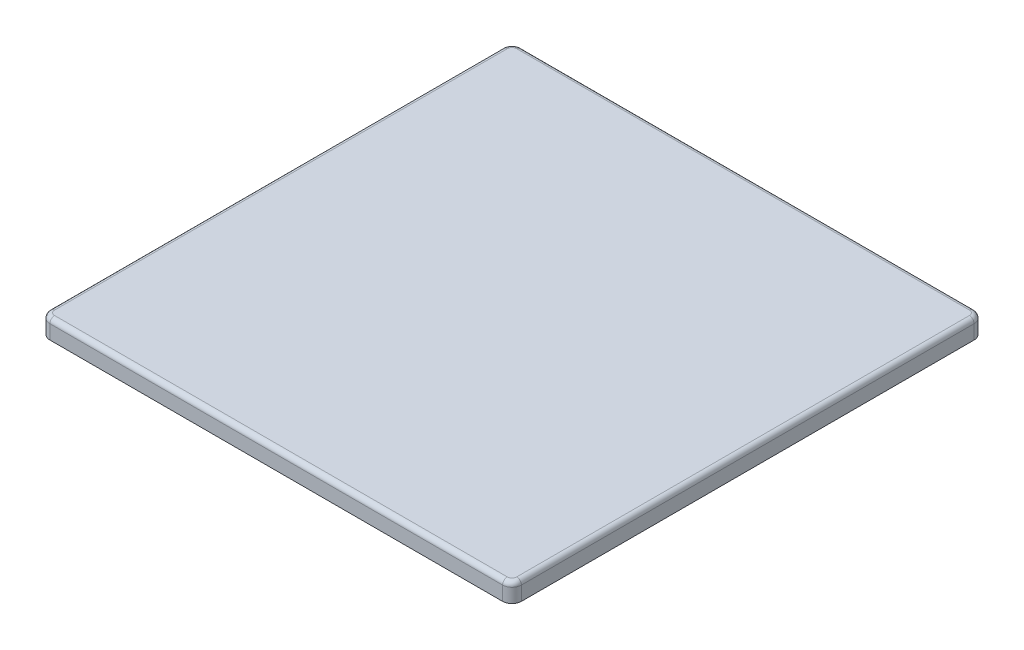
ISO-10303-21;
HEADER;
FILE_DESCRIPTION(('STEP AP214'),'2;1');
FILE_NAME('part.step','',(''),(''),'','','');
FILE_SCHEMA(('AUTOMOTIVE_DESIGN { 1 0 10303 214 1 1 1 1 }'));
ENDSEC;
DATA;
#1=APPLICATION_CONTEXT('core data for automotive mechanical design processes');
#2=APPLICATION_PROTOCOL_DEFINITION('international standard','automotive_design',2000,#1);
#3=PRODUCT_CONTEXT('',#1,'mechanical');
#4=PRODUCT('Part','Part','',(#3));
#5=PRODUCT_RELATED_PRODUCT_CATEGORY('part','',(#4));
#6=PRODUCT_DEFINITION_FORMATION('','',#4);
#7=PRODUCT_DEFINITION_CONTEXT('part definition',#1,'design');
#8=PRODUCT_DEFINITION('design','',#6,#7);
#9=PRODUCT_DEFINITION_SHAPE('','',#8);
#10=(LENGTH_UNIT() NAMED_UNIT(*) SI_UNIT(.MILLI.,.METRE.));
#11=(NAMED_UNIT(*) PLANE_ANGLE_UNIT() SI_UNIT($,.RADIAN.));
#12=(NAMED_UNIT(*) SI_UNIT($,.STERADIAN.) SOLID_ANGLE_UNIT());
#13=UNCERTAINTY_MEASURE_WITH_UNIT(LENGTH_MEASURE(1.E-05),#10,'distance_accuracy_value','');
#14=(GEOMETRIC_REPRESENTATION_CONTEXT(3) GLOBAL_UNCERTAINTY_ASSIGNED_CONTEXT((#13)) GLOBAL_UNIT_ASSIGNED_CONTEXT((#10,
#11,#12)) REPRESENTATION_CONTEXT('',''));
#15=CARTESIAN_POINT('',(0.,0.,0.));
#16=DIRECTION('',(0.,0.,1.));
#17=DIRECTION('',(1.,0.,0.));
#18=AXIS2_PLACEMENT_3D('',#15,#16,#17);
#19=CARTESIAN_POINT('',(-47.2,0.,47.2));
#20=DIRECTION('',(0.,-1.,0.));
#21=DIRECTION('',(0.,0.,-1.));
#22=AXIS2_PLACEMENT_3D('',#19,#20,#21);
#23=PLANE('',#22);
#24=DIRECTION('',(0.707106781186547,0.,0.707106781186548));
#25=VECTOR('',#24,1.);
#26=CARTESIAN_POINT('',(25.7071067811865,0.,21.2523340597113));
#27=LINE('',#26,#25);
#28=CARTESIAN_POINT('',(25.7071067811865,0.,21.2523340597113));
#29=VERTEX_POINT('',#28);
#30=CARTESIAN_POINT('',(28.7476659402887,0.,24.2928932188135));
#31=VERTEX_POINT('',#30);
#32=EDGE_CURVE('E355',#29,#31,#27,.T.);
#33=ORIENTED_EDGE('',*,*,#32,.F.);
#34=DIRECTION('',(0.707106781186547,0.,-0.707106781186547));
#35=VECTOR('',#34,1.);
#36=CARTESIAN_POINT('',(21.2523340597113,0.,25.7071067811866));
#37=LINE('',#36,#35);
#38=CARTESIAN_POINT('',(21.2523340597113,0.,25.7071067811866));
#39=VERTEX_POINT('',#38);
#40=EDGE_CURVE('E329',#39,#29,#37,.T.);
#41=ORIENTED_EDGE('',*,*,#40,.F.);
#42=DIRECTION('',(-0.707106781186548,0.,-0.707106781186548));
#43=VECTOR('',#42,1.);
#44=CARTESIAN_POINT('',(21.2523340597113,0.,25.7071067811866));
#45=LINE('',#44,#43);
#46=CARTESIAN_POINT('',(24.2928932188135,0.,28.7476659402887));
#47=VERTEX_POINT('',#46);
#48=EDGE_CURVE('E361',#47,#39,#45,.T.);
#49=ORIENTED_EDGE('',*,*,#48,.F.);
#50=DIRECTION('',(-0.707106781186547,0.,0.707106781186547));
#51=VECTOR('',#50,1.);
#52=CARTESIAN_POINT('',(24.2928932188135,0.,28.7476659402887));
#53=LINE('',#52,#51);
#54=EDGE_CURVE('E358',#31,#47,#53,.T.);
#55=ORIENTED_EDGE('',*,*,#54,.F.);
#56=EDGE_LOOP('',(#33,#41,#49,#55));
#57=FACE_BOUND('',#56,.T.);
#58=DIRECTION('',(0.707106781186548,0.,0.707106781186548));
#59=VECTOR('',#58,1.);
#60=CARTESIAN_POINT('',(-24.2928932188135,0.,21.2523340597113));
#61=LINE('',#60,#59);
#62=CARTESIAN_POINT('',(-24.2928932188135,0.,21.2523340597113));
#63=VERTEX_POINT('',#62);
#64=CARTESIAN_POINT('',(-21.2523340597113,0.,24.2928932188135));
#65=VERTEX_POINT('',#64);
#66=EDGE_CURVE('E395',#63,#65,#61,.T.);
#67=ORIENTED_EDGE('',*,*,#66,.F.);
#68=DIRECTION('',(0.707106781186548,0.,-0.707106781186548));
#69=VECTOR('',#68,1.);
#70=CARTESIAN_POINT('',(-28.7476659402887,0.,25.7071067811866));
#71=LINE('',#70,#69);
#72=CARTESIAN_POINT('',(-28.7476659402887,0.,25.7071067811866));
#73=VERTEX_POINT('',#72);
#74=EDGE_CURVE('E387',#73,#63,#71,.T.);
#75=ORIENTED_EDGE('',*,*,#74,.F.);
#76=DIRECTION('',(-0.707106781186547,0.,-0.707106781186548));
#77=VECTOR('',#76,1.);
#78=CARTESIAN_POINT('',(-28.7476659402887,0.,25.7071067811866));
#79=LINE('',#78,#77);
#80=CARTESIAN_POINT('',(-25.7071067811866,0.,28.7476659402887));
#81=VERTEX_POINT('',#80);
#82=EDGE_CURVE('E401',#81,#73,#79,.T.);
#83=ORIENTED_EDGE('',*,*,#82,.F.);
#84=DIRECTION('',(-0.707106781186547,0.,0.707106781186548));
#85=VECTOR('',#84,1.);
#86=CARTESIAN_POINT('',(-25.7071067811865,0.,28.7476659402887));
#87=LINE('',#86,#85);
#88=EDGE_CURVE('E398',#65,#81,#87,.T.);
#89=ORIENTED_EDGE('',*,*,#88,.F.);
#90=EDGE_LOOP('',(#67,#75,#83,#89));
#91=FACE_BOUND('',#90,.T.);
#92=CARTESIAN_POINT('',(-47.2,0.,47.2));
#93=DIRECTION('',(0.,-1.,0.));
#94=DIRECTION('',(0.,0.,-1.));
#95=AXIS2_PLACEMENT_3D('',#92,#93,#94);
#96=CIRCLE('',#95,0.800000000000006);
#97=CARTESIAN_POINT('',(-47.2,0.,48.));
#98=VERTEX_POINT('',#97);
#99=CARTESIAN_POINT('',(-48.,0.,47.2));
#100=VERTEX_POINT('',#99);
#101=EDGE_CURVE('E413',#98,#100,#96,.T.);
#102=ORIENTED_EDGE('',*,*,#101,.T.);
#103=DIRECTION('',(0.,0.,-1.));
#104=VECTOR('',#103,1.);
#105=CARTESIAN_POINT('',(-48.,0.,47.2));
#106=LINE('',#105,#104);
#107=CARTESIAN_POINT('',(-48.,0.,-47.2));
#108=VERTEX_POINT('',#107);
#109=EDGE_CURVE('E416',#100,#108,#106,.T.);
#110=ORIENTED_EDGE('',*,*,#109,.T.);
#111=CARTESIAN_POINT('',(-47.2,0.,-47.2));
#112=DIRECTION('',(0.,-1.,0.));
#113=DIRECTION('',(0.,0.,-1.));
#114=AXIS2_PLACEMENT_3D('',#111,#112,#113);
#115=CIRCLE('',#114,0.800000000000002);
#116=CARTESIAN_POINT('',(-47.2,0.,-48.));
#117=VERTEX_POINT('',#116);
#118=EDGE_CURVE('E420',#108,#117,#115,.T.);
#119=ORIENTED_EDGE('',*,*,#118,.T.);
#120=DIRECTION('',(1.,0.,0.));
#121=VECTOR('',#120,1.);
#122=CARTESIAN_POINT('',(-47.2,0.,-48.));
#123=LINE('',#122,#121);
#124=CARTESIAN_POINT('',(47.2,0.,-48.));
#125=VERTEX_POINT('',#124);
#126=EDGE_CURVE('E423',#117,#125,#123,.T.);
#127=ORIENTED_EDGE('',*,*,#126,.T.);
#128=CARTESIAN_POINT('',(47.2,0.,-47.2));
#129=DIRECTION('',(0.,-1.,0.));
#130=DIRECTION('',(0.,0.,-1.));
#131=AXIS2_PLACEMENT_3D('',#128,#129,#130);
#132=CIRCLE('',#131,0.800000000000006);
#133=CARTESIAN_POINT('',(48.,0.,-47.2));
#134=VERTEX_POINT('',#133);
#135=EDGE_CURVE('E426',#125,#134,#132,.T.);
#136=ORIENTED_EDGE('',*,*,#135,.T.);
#137=DIRECTION('',(0.,0.,1.));
#138=VECTOR('',#137,1.);
#139=CARTESIAN_POINT('',(48.,0.,47.2));
#140=LINE('',#139,#138);
#141=CARTESIAN_POINT('',(48.,0.,47.2));
#142=VERTEX_POINT('',#141);
#143=EDGE_CURVE('E429',#134,#142,#140,.T.);
#144=ORIENTED_EDGE('',*,*,#143,.T.);
#145=CARTESIAN_POINT('',(47.2,0.,47.2));
#146=DIRECTION('',(0.,-1.,0.));
#147=DIRECTION('',(0.,0.,-1.));
#148=AXIS2_PLACEMENT_3D('',#145,#146,#147);
#149=CIRCLE('',#148,0.800000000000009);
#150=CARTESIAN_POINT('',(47.2,0.,48.));
#151=VERTEX_POINT('',#150);
#152=EDGE_CURVE('E432',#142,#151,#149,.T.);
#153=ORIENTED_EDGE('',*,*,#152,.T.);
#154=DIRECTION('',(-1.,0.,0.));
#155=VECTOR('',#154,1.);
#156=CARTESIAN_POINT('',(-47.2,0.,48.));
#157=LINE('',#156,#155);
#158=EDGE_CURVE('E435',#151,#98,#157,.T.);
#159=ORIENTED_EDGE('',*,*,#158,.T.);
#160=EDGE_LOOP('',(#102,#110,#119,#127,#136,#144,#153,#159));
#161=FACE_BOUND('',#160,.T.);
#162=DIRECTION('',(0.707106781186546,0.,0.707106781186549));
#163=VECTOR('',#162,1.);
#164=CARTESIAN_POINT('',(-24.2928932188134,0.,-28.7476659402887));
#165=LINE('',#164,#163);
#166=CARTESIAN_POINT('',(-24.2928932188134,0.,-28.7476659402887));
#167=VERTEX_POINT('',#166);
#168=CARTESIAN_POINT('',(-21.2523340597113,0.,-25.7071067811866));
#169=VERTEX_POINT('',#168);
#170=EDGE_CURVE('E375',#167,#169,#165,.T.);
#171=ORIENTED_EDGE('',*,*,#170,.F.);
#172=DIRECTION('',(0.707106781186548,0.,-0.707106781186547));
#173=VECTOR('',#172,1.);
#174=CARTESIAN_POINT('',(-28.7476659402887,0.,-24.2928932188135));
#175=LINE('',#174,#173);
#176=CARTESIAN_POINT('',(-28.7476659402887,0.,-24.2928932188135));
#177=VERTEX_POINT('',#176);
#178=EDGE_CURVE('E367',#177,#167,#175,.T.);
#179=ORIENTED_EDGE('',*,*,#178,.F.);
#180=DIRECTION('',(-0.707106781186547,0.,-0.707106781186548));
#181=VECTOR('',#180,1.);
#182=CARTESIAN_POINT('',(-28.7476659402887,0.,-24.2928932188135));
#183=LINE('',#182,#181);
#184=CARTESIAN_POINT('',(-25.7071067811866,0.,-21.2523340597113));
#185=VERTEX_POINT('',#184);
#186=EDGE_CURVE('E381',#185,#177,#183,.T.);
#187=ORIENTED_EDGE('',*,*,#186,.F.);
#188=DIRECTION('',(-0.707106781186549,0.,0.707106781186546));
#189=VECTOR('',#188,1.);
#190=CARTESIAN_POINT('',(-25.7071067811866,0.,-21.2523340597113));
#191=LINE('',#190,#189);
#192=EDGE_CURVE('E378',#169,#185,#191,.T.);
#193=ORIENTED_EDGE('',*,*,#192,.F.);
#194=EDGE_LOOP('',(#171,#179,#187,#193));
#195=FACE_BOUND('',#194,.T.);
#196=DIRECTION('',(0.707106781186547,0.,0.707106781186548));
#197=VECTOR('',#196,1.);
#198=CARTESIAN_POINT('',(25.7071067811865,0.,-28.7476659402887));
#199=LINE('',#198,#197);
#200=CARTESIAN_POINT('',(25.7071067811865,0.,-28.7476659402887));
#201=VERTEX_POINT('',#200);
#202=CARTESIAN_POINT('',(28.7476659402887,0.,-25.7071067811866));
#203=VERTEX_POINT('',#202);
#204=EDGE_CURVE('E323',#201,#203,#199,.T.);
#205=ORIENTED_EDGE('',*,*,#204,.F.);
#206=DIRECTION('',(0.707106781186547,0.,-0.707106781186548));
#207=VECTOR('',#206,1.);
#208=CARTESIAN_POINT('',(21.2523340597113,0.,-24.2928932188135));
#209=LINE('',#208,#207);
#210=CARTESIAN_POINT('',(21.2523340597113,0.,-24.2928932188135));
#211=VERTEX_POINT('',#210);
#212=EDGE_CURVE('E333',#211,#201,#209,.T.);
#213=ORIENTED_EDGE('',*,*,#212,.F.);
#214=DIRECTION('',(-0.707106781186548,0.,-0.707106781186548));
#215=VECTOR('',#214,1.);
#216=CARTESIAN_POINT('',(21.2523340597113,0.,-24.2928932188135));
#217=LINE('',#216,#215);
#218=CARTESIAN_POINT('',(24.2928932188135,0.,-21.2523340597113));
#219=VERTEX_POINT('',#218);
#220=EDGE_CURVE('E345',#219,#211,#217,.T.);
#221=ORIENTED_EDGE('',*,*,#220,.F.);
#222=DIRECTION('',(-0.707106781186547,0.,0.707106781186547));
#223=VECTOR('',#222,1.);
#224=CARTESIAN_POINT('',(24.2928932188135,0.,-21.2523340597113));
#225=LINE('',#224,#223);
#226=EDGE_CURVE('E343',#203,#219,#225,.T.);
#227=ORIENTED_EDGE('',*,*,#226,.F.);
#228=EDGE_LOOP('',(#205,#213,#221,#227));
#229=FACE_BOUND('',#228,.T.);
#230=ADVANCED_FACE('F36',(#57,#91,#161,#195,#229),#23,.T.);
#231=CARTESIAN_POINT('',(-48.,2.,-48.));
#232=DIRECTION('',(0.,-1.,0.));
#233=DIRECTION('',(0.,0.,-1.));
#234=AXIS2_PLACEMENT_3D('',#231,#232,#233);
#235=CYLINDRICAL_SURFACE('',#234,2.);
#236=DIRECTION('',(0.,-1.,0.));
#237=VECTOR('',#236,1.);
#238=CARTESIAN_POINT('',(-50.,2.,-48.));
#239=LINE('',#238,#237);
#240=CARTESIAN_POINT('',(-50.,1.,-48.));
#241=VERTEX_POINT('',#240);
#242=CARTESIAN_POINT('',(-50.,-2.,-48.));
#243=VERTEX_POINT('',#242);
#244=EDGE_CURVE('E516',#241,#243,#239,.T.);
#245=ORIENTED_EDGE('',*,*,#244,.F.);
#246=CARTESIAN_POINT('',(-48.,1.,-48.));
#247=DIRECTION('',(0.,1.,0.));
#248=DIRECTION('',(0.,0.,1.));
#249=AXIS2_PLACEMENT_3D('',#246,#247,#248);
#250=CIRCLE('',#249,2.);
#251=CARTESIAN_POINT('',(-48.,1.,-50.));
#252=VERTEX_POINT('',#251);
#253=EDGE_CURVE('E540',#241,#252,#250,.F.);
#254=ORIENTED_EDGE('',*,*,#253,.T.);
#255=DIRECTION('',(0.,-1.,0.));
#256=VECTOR('',#255,1.);
#257=CARTESIAN_POINT('',(-48.,2.,-50.));
#258=LINE('',#257,#256);
#259=CARTESIAN_POINT('',(-48.,-2.,-50.));
#260=VERTEX_POINT('',#259);
#261=EDGE_CURVE('E502',#252,#260,#258,.T.);
#262=ORIENTED_EDGE('',*,*,#261,.T.);
#263=CARTESIAN_POINT('',(-48.,-2.,-48.));
#264=DIRECTION('',(0.,1.,0.));
#265=DIRECTION('',(0.,0.,1.));
#266=AXIS2_PLACEMENT_3D('',#263,#264,#265);
#267=CIRCLE('',#266,2.);
#268=EDGE_CURVE('E477',#260,#243,#267,.T.);
#269=ORIENTED_EDGE('',*,*,#268,.T.);
#270=EDGE_LOOP('',(#245,#254,#262,#269));
#271=FACE_BOUND('',#270,.T.);
#272=ADVANCED_FACE('F715',(#271),#235,.T.);
#273=CARTESIAN_POINT('',(-50.,2.,48.));
#274=DIRECTION('',(1.,0.,0.));
#275=DIRECTION('',(0.,0.,-1.));
#276=AXIS2_PLACEMENT_3D('',#273,#274,#275);
#277=PLANE('',#276);
#278=DIRECTION('',(0.,-1.,0.));
#279=VECTOR('',#278,1.);
#280=CARTESIAN_POINT('',(-50.,2.,48.));
#281=LINE('',#280,#279);
#282=CARTESIAN_POINT('',(-50.,1.,48.));
#283=VERTEX_POINT('',#282);
#284=CARTESIAN_POINT('',(-50.,-2.,48.));
#285=VERTEX_POINT('',#284);
#286=EDGE_CURVE('E514',#283,#285,#281,.T.);
#287=ORIENTED_EDGE('',*,*,#286,.F.);
#288=DIRECTION('',(0.,0.,1.));
#289=VECTOR('',#288,1.);
#290=CARTESIAN_POINT('',(-50.,1.,-48.));
#291=LINE('',#290,#289);
#292=EDGE_CURVE('E538',#283,#241,#291,.F.);
#293=ORIENTED_EDGE('',*,*,#292,.T.);
#294=ORIENTED_EDGE('',*,*,#244,.T.);
#295=DIRECTION('',(0.,0.,1.));
#296=VECTOR('',#295,1.);
#297=CARTESIAN_POINT('',(-50.,-2.,48.));
#298=LINE('',#297,#296);
#299=EDGE_CURVE('E480',#243,#285,#298,.T.);
#300=ORIENTED_EDGE('',*,*,#299,.T.);
#301=EDGE_LOOP('',(#287,#293,#294,#300));
#302=FACE_BOUND('',#301,.T.);
#303=ADVANCED_FACE('F721',(#302),#277,.F.);
#304=CARTESIAN_POINT('',(-48.,2.,48.));
#305=DIRECTION('',(0.,-1.,0.));
#306=DIRECTION('',(0.,0.,-1.));
#307=AXIS2_PLACEMENT_3D('',#304,#305,#306);
#308=CYLINDRICAL_SURFACE('',#307,2.);
#309=DIRECTION('',(0.,-1.,0.));
#310=VECTOR('',#309,1.);
#311=CARTESIAN_POINT('',(-48.,2.,50.));
#312=LINE('',#311,#310);
#313=CARTESIAN_POINT('',(-48.,1.,50.));
#314=VERTEX_POINT('',#313);
#315=CARTESIAN_POINT('',(-48.,-2.,50.));
#316=VERTEX_POINT('',#315);
#317=EDGE_CURVE('E512',#314,#316,#312,.T.);
#318=ORIENTED_EDGE('',*,*,#317,.F.);
#319=CARTESIAN_POINT('',(-48.,1.,48.));
#320=DIRECTION('',(0.,1.,0.));
#321=DIRECTION('',(0.,0.,1.));
#322=AXIS2_PLACEMENT_3D('',#319,#320,#321);
#323=CIRCLE('',#322,2.);
#324=EDGE_CURVE('E535',#314,#283,#323,.F.);
#325=ORIENTED_EDGE('',*,*,#324,.T.);
#326=ORIENTED_EDGE('',*,*,#286,.T.);
#327=CARTESIAN_POINT('',(-48.,-2.,48.));
#328=DIRECTION('',(0.,1.,0.));
#329=DIRECTION('',(0.,0.,1.));
#330=AXIS2_PLACEMENT_3D('',#327,#328,#329);
#331=CIRCLE('',#330,2.);
#332=EDGE_CURVE('E484',#285,#316,#331,.T.);
#333=ORIENTED_EDGE('',*,*,#332,.T.);
#334=EDGE_LOOP('',(#318,#325,#326,#333));
#335=FACE_BOUND('',#334,.T.);
#336=ADVANCED_FACE('F791',(#335),#308,.T.);
#337=CARTESIAN_POINT('',(-48.,2.,50.));
#338=DIRECTION('',(0.,0.,-1.));
#339=DIRECTION('',(-1.,0.,0.));
#340=AXIS2_PLACEMENT_3D('',#337,#338,#339);
#341=PLANE('',#340);
#342=DIRECTION('',(0.,-1.,0.));
#343=VECTOR('',#342,1.);
#344=CARTESIAN_POINT('',(48.,2.,50.));
#345=LINE('',#344,#343);
#346=CARTESIAN_POINT('',(48.,1.,50.));
#347=VERTEX_POINT('',#346);
#348=CARTESIAN_POINT('',(48.,-2.,50.));
#349=VERTEX_POINT('',#348);
#350=EDGE_CURVE('E510',#347,#349,#345,.T.);
#351=ORIENTED_EDGE('',*,*,#350,.F.);
#352=DIRECTION('',(1.,0.,0.));
#353=VECTOR('',#352,1.);
#354=CARTESIAN_POINT('',(-48.,1.,50.));
#355=LINE('',#354,#353);
#356=EDGE_CURVE('E550',#347,#314,#355,.F.);
#357=ORIENTED_EDGE('',*,*,#356,.T.);
#358=ORIENTED_EDGE('',*,*,#317,.T.);
#359=DIRECTION('',(1.,0.,0.));
#360=VECTOR('',#359,1.);
#361=CARTESIAN_POINT('',(-48.,-2.,50.));
#362=LINE('',#361,#360);
#363=EDGE_CURVE('E487',#316,#349,#362,.T.);
#364=ORIENTED_EDGE('',*,*,#363,.T.);
#365=EDGE_LOOP('',(#351,#357,#358,#364));
#366=FACE_BOUND('',#365,.T.);
#367=ADVANCED_FACE('F787',(#366),#341,.F.);
#368=CARTESIAN_POINT('',(48.,2.,48.));
#369=DIRECTION('',(0.,-1.,0.));
#370=DIRECTION('',(0.,0.,-1.));
#371=AXIS2_PLACEMENT_3D('',#368,#369,#370);
#372=CYLINDRICAL_SURFACE('',#371,2.00000000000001);
#373=DIRECTION('',(0.,-1.,0.));
#374=VECTOR('',#373,1.);
#375=CARTESIAN_POINT('',(50.,2.,48.));
#376=LINE('',#375,#374);
#377=CARTESIAN_POINT('',(50.,1.,48.));
#378=VERTEX_POINT('',#377);
#379=CARTESIAN_POINT('',(50.,-2.,48.));
#380=VERTEX_POINT('',#379);
#381=EDGE_CURVE('E508',#378,#380,#376,.T.);
#382=ORIENTED_EDGE('',*,*,#381,.F.);
#383=CARTESIAN_POINT('',(48.,1.,48.));
#384=DIRECTION('',(0.,1.,0.));
#385=DIRECTION('',(0.,0.,1.));
#386=AXIS2_PLACEMENT_3D('',#383,#384,#385);
#387=CIRCLE('',#386,2.00000000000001);
#388=EDGE_CURVE('E548',#378,#347,#387,.F.);
#389=ORIENTED_EDGE('',*,*,#388,.T.);
#390=ORIENTED_EDGE('',*,*,#350,.T.);
#391=CARTESIAN_POINT('',(48.,-2.,48.));
#392=DIRECTION('',(0.,1.,0.));
#393=DIRECTION('',(0.,0.,1.));
#394=AXIS2_PLACEMENT_3D('',#391,#392,#393);
#395=CIRCLE('',#394,2.00000000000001);
#396=EDGE_CURVE('E490',#349,#380,#395,.T.);
#397=ORIENTED_EDGE('',*,*,#396,.T.);
#398=EDGE_LOOP('',(#382,#389,#390,#397));
#399=FACE_BOUND('',#398,.T.);
#400=ADVANCED_FACE('F783',(#399),#372,.T.);
#401=CARTESIAN_POINT('',(50.,2.,48.));
#402=DIRECTION('',(-1.,0.,0.));
#403=DIRECTION('',(0.,0.,1.));
#404=AXIS2_PLACEMENT_3D('',#401,#402,#403);
#405=PLANE('',#404);
#406=DIRECTION('',(0.,-1.,0.));
#407=VECTOR('',#406,1.);
#408=CARTESIAN_POINT('',(50.,2.,-48.));
#409=LINE('',#408,#407);
#410=CARTESIAN_POINT('',(50.,1.,-48.));
#411=VERTEX_POINT('',#410);
#412=CARTESIAN_POINT('',(50.,-2.,-48.));
#413=VERTEX_POINT('',#412);
#414=EDGE_CURVE('E506',#411,#413,#409,.T.);
#415=ORIENTED_EDGE('',*,*,#414,.F.);
#416=DIRECTION('',(0.,0.,-1.));
#417=VECTOR('',#416,1.);
#418=CARTESIAN_POINT('',(50.,1.,48.));
#419=LINE('',#418,#417);
#420=EDGE_CURVE('E546',#411,#378,#419,.F.);
#421=ORIENTED_EDGE('',*,*,#420,.T.);
#422=ORIENTED_EDGE('',*,*,#381,.T.);
#423=DIRECTION('',(0.,0.,-1.));
#424=VECTOR('',#423,1.);
#425=CARTESIAN_POINT('',(50.,-2.,48.));
#426=LINE('',#425,#424);
#427=EDGE_CURVE('E493',#380,#413,#426,.T.);
#428=ORIENTED_EDGE('',*,*,#427,.T.);
#429=EDGE_LOOP('',(#415,#421,#422,#428));
#430=FACE_BOUND('',#429,.T.);
#431=ADVANCED_FACE('F779',(#430),#405,.F.);
#432=CARTESIAN_POINT('',(48.,2.,-48.));
#433=DIRECTION('',(0.,-1.,0.));
#434=DIRECTION('',(0.,0.,-1.));
#435=AXIS2_PLACEMENT_3D('',#432,#433,#434);
#436=CYLINDRICAL_SURFACE('',#435,2.00000000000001);
#437=DIRECTION('',(0.,-1.,0.));
#438=VECTOR('',#437,1.);
#439=CARTESIAN_POINT('',(48.,2.,-50.));
#440=LINE('',#439,#438);
#441=CARTESIAN_POINT('',(48.,1.,-50.));
#442=VERTEX_POINT('',#441);
#443=CARTESIAN_POINT('',(48.,-2.,-50.));
#444=VERTEX_POINT('',#443);
#445=EDGE_CURVE('E504',#442,#444,#440,.T.);
#446=ORIENTED_EDGE('',*,*,#445,.F.);
#447=CARTESIAN_POINT('',(48.,1.,-48.));
#448=DIRECTION('',(0.,1.,0.));
#449=DIRECTION('',(0.,0.,1.));
#450=AXIS2_PLACEMENT_3D('',#447,#448,#449);
#451=CIRCLE('',#450,2.00000000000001);
#452=EDGE_CURVE('E544',#442,#411,#451,.F.);
#453=ORIENTED_EDGE('',*,*,#452,.T.);
#454=ORIENTED_EDGE('',*,*,#414,.T.);
#455=CARTESIAN_POINT('',(48.,-2.,-48.));
#456=DIRECTION('',(0.,1.,0.));
#457=DIRECTION('',(0.,0.,1.));
#458=AXIS2_PLACEMENT_3D('',#455,#456,#457);
#459=CIRCLE('',#458,2.00000000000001);
#460=EDGE_CURVE('E496',#413,#444,#459,.T.);
#461=ORIENTED_EDGE('',*,*,#460,.T.);
#462=EDGE_LOOP('',(#446,#453,#454,#461));
#463=FACE_BOUND('',#462,.T.);
#464=ADVANCED_FACE('F775',(#463),#436,.T.);
#465=CARTESIAN_POINT('',(-48.,2.,-50.));
#466=DIRECTION('',(0.,0.,1.));
#467=DIRECTION('',(1.,0.,0.));
#468=AXIS2_PLACEMENT_3D('',#465,#466,#467);
#469=PLANE('',#468);
#470=ORIENTED_EDGE('',*,*,#261,.F.);
#471=DIRECTION('',(-1.,0.,0.));
#472=VECTOR('',#471,1.);
#473=CARTESIAN_POINT('',(48.,1.,-50.));
#474=LINE('',#473,#472);
#475=EDGE_CURVE('E542',#252,#442,#474,.F.);
#476=ORIENTED_EDGE('',*,*,#475,.T.);
#477=ORIENTED_EDGE('',*,*,#445,.T.);
#478=DIRECTION('',(-1.,0.,0.));
#479=VECTOR('',#478,1.);
#480=CARTESIAN_POINT('',(-48.,-2.,-50.));
#481=LINE('',#480,#479);
#482=EDGE_CURVE('E499',#444,#260,#481,.T.);
#483=ORIENTED_EDGE('',*,*,#482,.T.);
#484=EDGE_LOOP('',(#470,#476,#477,#483));
#485=FACE_BOUND('',#484,.T.);
#486=ADVANCED_FACE('F767',(#485),#469,.F.);
#487=CARTESIAN_POINT('',(-48.,2.,-48.));
#488=DIRECTION('',(0.,1.,0.));
#489=DIRECTION('',(0.,0.,1.));
#490=AXIS2_PLACEMENT_3D('',#487,#488,#489);
#491=PLANE('',#490);
#492=DIRECTION('',(0.,0.,1.));
#493=VECTOR('',#492,1.);
#494=CARTESIAN_POINT('',(-49.,2.,48.));
#495=LINE('',#494,#493);
#496=CARTESIAN_POINT('',(-49.,2.,-48.));
#497=VERTEX_POINT('',#496);
#498=CARTESIAN_POINT('',(-49.,2.,48.));
#499=VERTEX_POINT('',#498);
#500=EDGE_CURVE('E530',#497,#499,#495,.T.);
#501=ORIENTED_EDGE('',*,*,#500,.T.);
#502=CARTESIAN_POINT('',(-48.,2.,48.));
#503=DIRECTION('',(0.,1.,0.));
#504=DIRECTION('',(0.,0.,1.));
#505=AXIS2_PLACEMENT_3D('',#502,#503,#504);
#506=CIRCLE('',#505,1.);
#507=CARTESIAN_POINT('',(-48.,2.,49.));
#508=VERTEX_POINT('',#507);
#509=EDGE_CURVE('E532',#499,#508,#506,.T.);
#510=ORIENTED_EDGE('',*,*,#509,.T.);
#511=DIRECTION('',(1.,0.,0.));
#512=VECTOR('',#511,1.);
#513=CARTESIAN_POINT('',(48.,2.,49.));
#514=LINE('',#513,#512);
#515=CARTESIAN_POINT('',(48.,2.,49.));
#516=VERTEX_POINT('',#515);
#517=EDGE_CURVE('E518',#508,#516,#514,.T.);
#518=ORIENTED_EDGE('',*,*,#517,.T.);
#519=CARTESIAN_POINT('',(48.,2.,48.));
#520=DIRECTION('',(0.,1.,0.));
#521=DIRECTION('',(0.,0.,1.));
#522=AXIS2_PLACEMENT_3D('',#519,#520,#521);
#523=CIRCLE('',#522,1.00000000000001);
#524=CARTESIAN_POINT('',(49.,2.,48.));
#525=VERTEX_POINT('',#524);
#526=EDGE_CURVE('E520',#516,#525,#523,.T.);
#527=ORIENTED_EDGE('',*,*,#526,.T.);
#528=DIRECTION('',(0.,0.,-1.));
#529=VECTOR('',#528,1.);
#530=CARTESIAN_POINT('',(49.,2.,-48.));
#531=LINE('',#530,#529);
#532=CARTESIAN_POINT('',(49.,2.,-48.));
#533=VERTEX_POINT('',#532);
#534=EDGE_CURVE('E522',#525,#533,#531,.T.);
#535=ORIENTED_EDGE('',*,*,#534,.T.);
#536=CARTESIAN_POINT('',(48.,2.,-48.));
#537=DIRECTION('',(0.,1.,0.));
#538=DIRECTION('',(0.,0.,1.));
#539=AXIS2_PLACEMENT_3D('',#536,#537,#538);
#540=CIRCLE('',#539,1.00000000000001);
#541=CARTESIAN_POINT('',(48.,2.,-49.));
#542=VERTEX_POINT('',#541);
#543=EDGE_CURVE('E524',#533,#542,#540,.T.);
#544=ORIENTED_EDGE('',*,*,#543,.T.);
#545=DIRECTION('',(-1.,0.,0.));
#546=VECTOR('',#545,1.);
#547=CARTESIAN_POINT('',(-48.,2.,-49.));
#548=LINE('',#547,#546);
#549=CARTESIAN_POINT('',(-48.,2.,-49.));
#550=VERTEX_POINT('',#549);
#551=EDGE_CURVE('E526',#542,#550,#548,.T.);
#552=ORIENTED_EDGE('',*,*,#551,.T.);
#553=CARTESIAN_POINT('',(-48.,2.,-48.));
#554=DIRECTION('',(0.,1.,0.));
#555=DIRECTION('',(0.,0.,1.));
#556=AXIS2_PLACEMENT_3D('',#553,#554,#555);
#557=CIRCLE('',#556,1.);
#558=EDGE_CURVE('E528',#550,#497,#557,.T.);
#559=ORIENTED_EDGE('',*,*,#558,.T.);
#560=EDGE_LOOP('',(#501,#510,#518,#527,#535,#544,#552,#559));
#561=FACE_BOUND('',#560,.T.);
#562=ADVANCED_FACE('F763',(#561),#491,.T.);
#563=CARTESIAN_POINT('',(-48.,-2.,-48.));
#564=DIRECTION('',(0.,1.,0.));
#565=DIRECTION('',(0.,0.,1.));
#566=AXIS2_PLACEMENT_3D('',#563,#564,#565);
#567=PLANE('',#566);
#568=DIRECTION('',(0.,0.,-1.));
#569=VECTOR('',#568,1.);
#570=CARTESIAN_POINT('',(-48.,-2.,47.2));
#571=LINE('',#570,#569);
#572=CARTESIAN_POINT('',(-48.,-2.,47.2));
#573=VERTEX_POINT('',#572);
#574=CARTESIAN_POINT('',(-48.,-2.,-47.2));
#575=VERTEX_POINT('',#574);
#576=EDGE_CURVE('E440',#573,#575,#571,.T.);
#577=ORIENTED_EDGE('',*,*,#576,.F.);
#578=CARTESIAN_POINT('',(-47.2,-2.,47.2));
#579=DIRECTION('',(0.,-1.,0.));
#580=DIRECTION('',(0.,0.,-1.));
#581=AXIS2_PLACEMENT_3D('',#578,#579,#580);
#582=CIRCLE('',#581,0.800000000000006);
#583=CARTESIAN_POINT('',(-47.2,-2.,48.));
#584=VERTEX_POINT('',#583);
#585=EDGE_CURVE('E407',#584,#573,#582,.T.);
#586=ORIENTED_EDGE('',*,*,#585,.F.);
#587=DIRECTION('',(-1.,0.,0.));
#588=VECTOR('',#587,1.);
#589=CARTESIAN_POINT('',(-47.2,-2.,48.));
#590=LINE('',#589,#588);
#591=CARTESIAN_POINT('',(47.2,-2.,48.));
#592=VERTEX_POINT('',#591);
#593=EDGE_CURVE('E417',#592,#584,#590,.T.);
#594=ORIENTED_EDGE('',*,*,#593,.F.);
#595=CARTESIAN_POINT('',(47.2,-2.,47.2));
#596=DIRECTION('',(0.,-1.,0.));
#597=DIRECTION('',(0.,0.,-1.));
#598=AXIS2_PLACEMENT_3D('',#595,#596,#597);
#599=CIRCLE('',#598,0.800000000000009);
#600=CARTESIAN_POINT('',(48.,-2.,47.2));
#601=VERTEX_POINT('',#600);
#602=EDGE_CURVE('E455',#601,#592,#599,.T.);
#603=ORIENTED_EDGE('',*,*,#602,.F.);
#604=DIRECTION('',(0.,0.,1.));
#605=VECTOR('',#604,1.);
#606=CARTESIAN_POINT('',(48.,-2.,47.2));
#607=LINE('',#606,#605);
#608=CARTESIAN_POINT('',(48.,-2.,-47.2));
#609=VERTEX_POINT('',#608);
#610=EDGE_CURVE('E452',#609,#601,#607,.T.);
#611=ORIENTED_EDGE('',*,*,#610,.F.);
#612=CARTESIAN_POINT('',(47.2,-2.,-47.2));
#613=DIRECTION('',(0.,-1.,0.));
#614=DIRECTION('',(0.,0.,-1.));
#615=AXIS2_PLACEMENT_3D('',#612,#613,#614);
#616=CIRCLE('',#615,0.800000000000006);
#617=CARTESIAN_POINT('',(47.2,-2.,-48.));
#618=VERTEX_POINT('',#617);
#619=EDGE_CURVE('E449',#618,#609,#616,.T.);
#620=ORIENTED_EDGE('',*,*,#619,.F.);
#621=DIRECTION('',(1.,0.,0.));
#622=VECTOR('',#621,1.);
#623=CARTESIAN_POINT('',(-47.2,-2.,-48.));
#624=LINE('',#623,#622);
#625=CARTESIAN_POINT('',(-47.2,-2.,-48.));
#626=VERTEX_POINT('',#625);
#627=EDGE_CURVE('E446',#626,#618,#624,.T.);
#628=ORIENTED_EDGE('',*,*,#627,.F.);
#629=CARTESIAN_POINT('',(-47.2,-2.,-47.2));
#630=DIRECTION('',(0.,-1.,0.));
#631=DIRECTION('',(0.,0.,-1.));
#632=AXIS2_PLACEMENT_3D('',#629,#630,#631);
#633=CIRCLE('',#632,0.800000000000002);
#634=EDGE_CURVE('E443',#575,#626,#633,.T.);
#635=ORIENTED_EDGE('',*,*,#634,.F.);
#636=EDGE_LOOP('',(#577,#586,#594,#603,#611,#620,#628,#635));
#637=FACE_BOUND('',#636,.T.);
#638=ORIENTED_EDGE('',*,*,#268,.F.);
#639=ORIENTED_EDGE('',*,*,#482,.F.);
#640=ORIENTED_EDGE('',*,*,#460,.F.);
#641=ORIENTED_EDGE('',*,*,#427,.F.);
#642=ORIENTED_EDGE('',*,*,#396,.F.);
#643=ORIENTED_EDGE('',*,*,#363,.F.);
#644=ORIENTED_EDGE('',*,*,#332,.F.);
#645=ORIENTED_EDGE('',*,*,#299,.F.);
#646=EDGE_LOOP('',(#638,#639,#640,#641,#642,#643,#644,#645));
#647=FACE_BOUND('',#646,.T.);
#648=ADVANCED_FACE('F766',(#637,#647),#567,.F.);
#649=CARTESIAN_POINT('',(48.,1.,-48.));
#650=DIRECTION('',(0.,1.,0.));
#651=DIRECTION('',(0.,0.,1.));
#652=AXIS2_PLACEMENT_3D('',#649,#650,#651);
#653=TOROIDAL_SURFACE('',#652,1.00000000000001,1.);
#654=CARTESIAN_POINT('',(49.,1.,-48.));
#655=DIRECTION('',(0.,0.,1.));
#656=DIRECTION('',(1.,0.,0.));
#657=AXIS2_PLACEMENT_3D('',#654,#655,#656);
#658=CIRCLE('',#657,1.);
#659=EDGE_CURVE('E568',#411,#533,#658,.T.);
#660=ORIENTED_EDGE('',*,*,#659,.F.);
#661=ORIENTED_EDGE('',*,*,#452,.F.);
#662=CARTESIAN_POINT('',(48.,1.,-49.));
#663=DIRECTION('',(-1.,0.,0.));
#664=DIRECTION('',(0.,0.,1.));
#665=AXIS2_PLACEMENT_3D('',#662,#663,#664);
#666=CIRCLE('',#665,1.);
#667=EDGE_CURVE('E481',#542,#442,#666,.T.);
#668=ORIENTED_EDGE('',*,*,#667,.F.);
#669=ORIENTED_EDGE('',*,*,#543,.F.);
#670=EDGE_LOOP('',(#660,#661,#668,#669));
#671=FACE_BOUND('',#670,.T.);
#672=ADVANCED_FACE('F771',(#671),#653,.T.);
#673=CARTESIAN_POINT('',(-48.,1.,-49.));
#674=DIRECTION('',(1.,0.,0.));
#675=DIRECTION('',(0.,0.,-1.));
#676=AXIS2_PLACEMENT_3D('',#673,#674,#675);
#677=CYLINDRICAL_SURFACE('',#676,1.);
#678=ORIENTED_EDGE('',*,*,#667,.T.);
#679=ORIENTED_EDGE('',*,*,#475,.F.);
#680=CARTESIAN_POINT('',(-48.,1.,-49.));
#681=DIRECTION('',(-1.,0.,0.));
#682=DIRECTION('',(0.,0.,1.));
#683=AXIS2_PLACEMENT_3D('',#680,#681,#682);
#684=CIRCLE('',#683,1.);
#685=EDGE_CURVE('E565',#550,#252,#684,.T.);
#686=ORIENTED_EDGE('',*,*,#685,.F.);
#687=ORIENTED_EDGE('',*,*,#551,.F.);
#688=EDGE_LOOP('',(#678,#679,#686,#687));
#689=FACE_BOUND('',#688,.T.);
#690=ADVANCED_FACE('F821',(#689),#677,.T.);
#691=CARTESIAN_POINT('',(49.,1.,-48.));
#692=DIRECTION('',(0.,0.,1.));
#693=DIRECTION('',(1.,0.,0.));
#694=AXIS2_PLACEMENT_3D('',#691,#692,#693);
#695=CYLINDRICAL_SURFACE('',#694,1.);
#696=ORIENTED_EDGE('',*,*,#659,.T.);
#697=ORIENTED_EDGE('',*,*,#534,.F.);
#698=CARTESIAN_POINT('',(49.,1.,48.));
#699=DIRECTION('',(0.,0.,1.));
#700=DIRECTION('',(1.,0.,0.));
#701=AXIS2_PLACEMENT_3D('',#698,#699,#700);
#702=CIRCLE('',#701,1.);
#703=EDGE_CURVE('E562',#378,#525,#702,.T.);
#704=ORIENTED_EDGE('',*,*,#703,.F.);
#705=ORIENTED_EDGE('',*,*,#420,.F.);
#706=EDGE_LOOP('',(#696,#697,#704,#705));
#707=FACE_BOUND('',#706,.T.);
#708=ADVANCED_FACE('F817',(#707),#695,.T.);
#709=CARTESIAN_POINT('',(-48.,1.,-48.));
#710=DIRECTION('',(0.,1.,0.));
#711=DIRECTION('',(0.,0.,1.));
#712=AXIS2_PLACEMENT_3D('',#709,#710,#711);
#713=TOROIDAL_SURFACE('',#712,1.,1.);
#714=ORIENTED_EDGE('',*,*,#685,.T.);
#715=ORIENTED_EDGE('',*,*,#253,.F.);
#716=CARTESIAN_POINT('',(-49.,1.,-48.));
#717=DIRECTION('',(0.,0.,1.));
#718=DIRECTION('',(1.,0.,0.));
#719=AXIS2_PLACEMENT_3D('',#716,#717,#718);
#720=CIRCLE('',#719,1.);
#721=EDGE_CURVE('E559',#497,#241,#720,.T.);
#722=ORIENTED_EDGE('',*,*,#721,.F.);
#723=ORIENTED_EDGE('',*,*,#558,.F.);
#724=EDGE_LOOP('',(#714,#715,#722,#723));
#725=FACE_BOUND('',#724,.T.);
#726=ADVANCED_FACE('F813',(#725),#713,.T.);
#727=CARTESIAN_POINT('',(48.,1.,48.));
#728=DIRECTION('',(0.,1.,0.));
#729=DIRECTION('',(0.,0.,1.));
#730=AXIS2_PLACEMENT_3D('',#727,#728,#729);
#731=TOROIDAL_SURFACE('',#730,1.00000000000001,1.);
#732=ORIENTED_EDGE('',*,*,#703,.T.);
#733=ORIENTED_EDGE('',*,*,#526,.F.);
#734=CARTESIAN_POINT('',(48.,1.,49.));
#735=DIRECTION('',(-1.,0.,0.));
#736=DIRECTION('',(0.,0.,1.));
#737=AXIS2_PLACEMENT_3D('',#734,#735,#736);
#738=CIRCLE('',#737,1.);
#739=EDGE_CURVE('E556',#347,#516,#738,.T.);
#740=ORIENTED_EDGE('',*,*,#739,.F.);
#741=ORIENTED_EDGE('',*,*,#388,.F.);
#742=EDGE_LOOP('',(#732,#733,#740,#741));
#743=FACE_BOUND('',#742,.T.);
#744=ADVANCED_FACE('F809',(#743),#731,.T.);
#745=CARTESIAN_POINT('',(-49.,1.,-48.));
#746=DIRECTION('',(0.,0.,-1.));
#747=DIRECTION('',(-1.,0.,0.));
#748=AXIS2_PLACEMENT_3D('',#745,#746,#747);
#749=CYLINDRICAL_SURFACE('',#748,1.);
#750=ORIENTED_EDGE('',*,*,#721,.T.);
#751=ORIENTED_EDGE('',*,*,#292,.F.);
#752=CARTESIAN_POINT('',(-49.,1.,48.));
#753=DIRECTION('',(0.,0.,1.));
#754=DIRECTION('',(1.,0.,0.));
#755=AXIS2_PLACEMENT_3D('',#752,#753,#754);
#756=CIRCLE('',#755,1.);
#757=EDGE_CURVE('E554',#499,#283,#756,.T.);
#758=ORIENTED_EDGE('',*,*,#757,.F.);
#759=ORIENTED_EDGE('',*,*,#500,.F.);
#760=EDGE_LOOP('',(#750,#751,#758,#759));
#761=FACE_BOUND('',#760,.T.);
#762=ADVANCED_FACE('F805',(#761),#749,.T.);
#763=CARTESIAN_POINT('',(-48.,1.,49.));
#764=DIRECTION('',(-1.,0.,0.));
#765=DIRECTION('',(0.,0.,1.));
#766=AXIS2_PLACEMENT_3D('',#763,#764,#765);
#767=CYLINDRICAL_SURFACE('',#766,1.);
#768=ORIENTED_EDGE('',*,*,#739,.T.);
#769=ORIENTED_EDGE('',*,*,#517,.F.);
#770=CARTESIAN_POINT('',(-48.,1.,49.));
#771=DIRECTION('',(-1.,0.,0.));
#772=DIRECTION('',(0.,0.,1.));
#773=AXIS2_PLACEMENT_3D('',#770,#771,#772);
#774=CIRCLE('',#773,1.);
#775=EDGE_CURVE('E462',#314,#508,#774,.T.);
#776=ORIENTED_EDGE('',*,*,#775,.F.);
#777=ORIENTED_EDGE('',*,*,#356,.F.);
#778=EDGE_LOOP('',(#768,#769,#776,#777));
#779=FACE_BOUND('',#778,.T.);
#780=ADVANCED_FACE('F801',(#779),#767,.T.);
#781=CARTESIAN_POINT('',(-48.,1.,48.));
#782=DIRECTION('',(0.,1.,0.));
#783=DIRECTION('',(0.,0.,1.));
#784=AXIS2_PLACEMENT_3D('',#781,#782,#783);
#785=TOROIDAL_SURFACE('',#784,1.,1.);
#786=ORIENTED_EDGE('',*,*,#757,.T.);
#787=ORIENTED_EDGE('',*,*,#324,.F.);
#788=ORIENTED_EDGE('',*,*,#775,.T.);
#789=ORIENTED_EDGE('',*,*,#509,.F.);
#790=EDGE_LOOP('',(#786,#787,#788,#789));
#791=FACE_BOUND('',#790,.T.);
#792=ADVANCED_FACE('F761',(#791),#785,.T.);
#793=CARTESIAN_POINT('',(-47.2,0.,47.2));
#794=DIRECTION('',(0.,-1.,0.));
#795=DIRECTION('',(0.,0.,-1.));
#796=AXIS2_PLACEMENT_3D('',#793,#794,#795);
#797=CYLINDRICAL_SURFACE('',#796,0.800000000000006);
#798=ORIENTED_EDGE('',*,*,#585,.T.);
#799=DIRECTION('',(0.,-1.,0.));
#800=VECTOR('',#799,1.);
#801=CARTESIAN_POINT('',(-48.,0.,47.2));
#802=LINE('',#801,#800);
#803=EDGE_CURVE('E438',#100,#573,#802,.T.);
#804=ORIENTED_EDGE('',*,*,#803,.F.);
#805=ORIENTED_EDGE('',*,*,#101,.F.);
#806=DIRECTION('',(0.,-1.,0.));
#807=VECTOR('',#806,1.);
#808=CARTESIAN_POINT('',(-47.2,0.,48.));
#809=LINE('',#808,#807);
#810=EDGE_CURVE('E460',#98,#584,#809,.T.);
#811=ORIENTED_EDGE('',*,*,#810,.T.);
#812=EDGE_LOOP('',(#798,#804,#805,#811));
#813=FACE_BOUND('',#812,.T.);
#814=ADVANCED_FACE('F734',(#813),#797,.F.);
#815=CARTESIAN_POINT('',(-47.2,0.,48.));
#816=DIRECTION('',(0.,0.,1.));
#817=DIRECTION('',(1.,0.,0.));
#818=AXIS2_PLACEMENT_3D('',#815,#816,#817);
#819=PLANE('',#818);
#820=ORIENTED_EDGE('',*,*,#593,.T.);
#821=ORIENTED_EDGE('',*,*,#810,.F.);
#822=ORIENTED_EDGE('',*,*,#158,.F.);
#823=DIRECTION('',(0.,-1.,0.));
#824=VECTOR('',#823,1.);
#825=CARTESIAN_POINT('',(47.2,0.,48.));
#826=LINE('',#825,#824);
#827=EDGE_CURVE('E463',#151,#592,#826,.T.);
#828=ORIENTED_EDGE('',*,*,#827,.T.);
#829=EDGE_LOOP('',(#820,#821,#822,#828));
#830=FACE_BOUND('',#829,.T.);
#831=ADVANCED_FACE('F730',(#830),#819,.F.);
#832=CARTESIAN_POINT('',(47.2,0.,47.2));
#833=DIRECTION('',(0.,-1.,0.));
#834=DIRECTION('',(0.,0.,-1.));
#835=AXIS2_PLACEMENT_3D('',#832,#833,#834);
#836=CYLINDRICAL_SURFACE('',#835,0.800000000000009);
#837=ORIENTED_EDGE('',*,*,#602,.T.);
#838=ORIENTED_EDGE('',*,*,#827,.F.);
#839=ORIENTED_EDGE('',*,*,#152,.F.);
#840=DIRECTION('',(0.,-1.,0.));
#841=VECTOR('',#840,1.);
#842=CARTESIAN_POINT('',(48.,0.,47.2));
#843=LINE('',#842,#841);
#844=EDGE_CURVE('E465',#142,#601,#843,.T.);
#845=ORIENTED_EDGE('',*,*,#844,.T.);
#846=EDGE_LOOP('',(#837,#838,#839,#845));
#847=FACE_BOUND('',#846,.T.);
#848=ADVANCED_FACE('F733',(#847),#836,.F.);
#849=CARTESIAN_POINT('',(48.,0.,47.2));
#850=DIRECTION('',(1.,0.,0.));
#851=DIRECTION('',(0.,0.,-1.));
#852=AXIS2_PLACEMENT_3D('',#849,#850,#851);
#853=PLANE('',#852);
#854=ORIENTED_EDGE('',*,*,#610,.T.);
#855=ORIENTED_EDGE('',*,*,#844,.F.);
#856=ORIENTED_EDGE('',*,*,#143,.F.);
#857=DIRECTION('',(0.,-1.,0.));
#858=VECTOR('',#857,1.);
#859=CARTESIAN_POINT('',(48.,0.,-47.2));
#860=LINE('',#859,#858);
#861=EDGE_CURVE('E467',#134,#609,#860,.T.);
#862=ORIENTED_EDGE('',*,*,#861,.T.);
#863=EDGE_LOOP('',(#854,#855,#856,#862));
#864=FACE_BOUND('',#863,.T.);
#865=ADVANCED_FACE('F738',(#864),#853,.F.);
#866=CARTESIAN_POINT('',(47.2,0.,-47.2));
#867=DIRECTION('',(0.,-1.,0.));
#868=DIRECTION('',(0.,0.,-1.));
#869=AXIS2_PLACEMENT_3D('',#866,#867,#868);
#870=CYLINDRICAL_SURFACE('',#869,0.800000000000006);
#871=ORIENTED_EDGE('',*,*,#619,.T.);
#872=ORIENTED_EDGE('',*,*,#861,.F.);
#873=ORIENTED_EDGE('',*,*,#135,.F.);
#874=DIRECTION('',(0.,-1.,0.));
#875=VECTOR('',#874,1.);
#876=CARTESIAN_POINT('',(47.2,0.,-48.));
#877=LINE('',#876,#875);
#878=EDGE_CURVE('E469',#125,#618,#877,.T.);
#879=ORIENTED_EDGE('',*,*,#878,.T.);
#880=EDGE_LOOP('',(#871,#872,#873,#879));
#881=FACE_BOUND('',#880,.T.);
#882=ADVANCED_FACE('F742',(#881),#870,.F.);
#883=CARTESIAN_POINT('',(-47.2,0.,-48.));
#884=DIRECTION('',(0.,0.,-1.));
#885=DIRECTION('',(-1.,0.,0.));
#886=AXIS2_PLACEMENT_3D('',#883,#884,#885);
#887=PLANE('',#886);
#888=ORIENTED_EDGE('',*,*,#627,.T.);
#889=ORIENTED_EDGE('',*,*,#878,.F.);
#890=ORIENTED_EDGE('',*,*,#126,.F.);
#891=DIRECTION('',(0.,-1.,0.));
#892=VECTOR('',#891,1.);
#893=CARTESIAN_POINT('',(-47.2,0.,-48.));
#894=LINE('',#893,#892);
#895=EDGE_CURVE('E471',#117,#626,#894,.T.);
#896=ORIENTED_EDGE('',*,*,#895,.T.);
#897=EDGE_LOOP('',(#888,#889,#890,#896));
#898=FACE_BOUND('',#897,.T.);
#899=ADVANCED_FACE('F746',(#898),#887,.F.);
#900=CARTESIAN_POINT('',(-47.2,0.,-47.2));
#901=DIRECTION('',(0.,-1.,0.));
#902=DIRECTION('',(0.,0.,-1.));
#903=AXIS2_PLACEMENT_3D('',#900,#901,#902);
#904=CYLINDRICAL_SURFACE('',#903,0.800000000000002);
#905=ORIENTED_EDGE('',*,*,#634,.T.);
#906=ORIENTED_EDGE('',*,*,#895,.F.);
#907=ORIENTED_EDGE('',*,*,#118,.F.);
#908=DIRECTION('',(0.,-1.,0.));
#909=VECTOR('',#908,1.);
#910=CARTESIAN_POINT('',(-48.,0.,-47.2));
#911=LINE('',#910,#909);
#912=EDGE_CURVE('E473',#108,#575,#911,.T.);
#913=ORIENTED_EDGE('',*,*,#912,.T.);
#914=EDGE_LOOP('',(#905,#906,#907,#913));
#915=FACE_BOUND('',#914,.T.);
#916=ADVANCED_FACE('F750',(#915),#904,.F.);
#917=CARTESIAN_POINT('',(-48.,0.,47.2));
#918=DIRECTION('',(-1.,0.,0.));
#919=DIRECTION('',(0.,0.,1.));
#920=AXIS2_PLACEMENT_3D('',#917,#918,#919);
#921=PLANE('',#920);
#922=ORIENTED_EDGE('',*,*,#576,.T.);
#923=ORIENTED_EDGE('',*,*,#912,.F.);
#924=ORIENTED_EDGE('',*,*,#109,.F.);
#925=ORIENTED_EDGE('',*,*,#803,.T.);
#926=EDGE_LOOP('',(#922,#923,#924,#925));
#927=FACE_BOUND('',#926,.T.);
#928=ADVANCED_FACE('F754',(#927),#921,.F.);
#929=CARTESIAN_POINT('',(-28.7476659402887,0.,25.7071067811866));
#930=DIRECTION('',(-0.707079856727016,-0.00872653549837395,-0.707079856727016));
#931=DIRECTION('',(-0.707106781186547,0.,0.707106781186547));
#932=AXIS2_PLACEMENT_3D('',#929,#930,#931);
#933=PLANE('',#932);
#934=DIRECTION('',(0.,0.99992385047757,-0.01234071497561));
#935=VECTOR('',#934,1.);
#936=CARTESIAN_POINT('',(-24.2928932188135,0.,21.2523340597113));
#937=LINE('',#936,#935);
#938=CARTESIAN_POINT('',(-24.2928932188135,-10.2069812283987,21.3783050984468));
#939=VERTEX_POINT('',#938);
#940=EDGE_CURVE('E405',#939,#63,#937,.T.);
#941=ORIENTED_EDGE('',*,*,#940,.F.);
#942=DIRECTION('',(0.707106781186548,0.,-0.707106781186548));
#943=VECTOR('',#942,1.);
#944=CARTESIAN_POINT('',(-28.6168013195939,-10.2069812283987,25.7022131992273));
#945=LINE('',#944,#943);
#946=CARTESIAN_POINT('',(-28.6216949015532,-10.2069812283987,25.7071067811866));
#947=VERTEX_POINT('',#946);
#948=EDGE_CURVE('E11',#939,#947,#945,.F.);
#949=ORIENTED_EDGE('',*,*,#948,.T.);
#950=DIRECTION('',(-0.01234071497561,0.99992385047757,0.));
#951=VECTOR('',#950,1.);
#952=CARTESIAN_POINT('',(-28.7476659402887,0.,25.7071067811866));
#953=LINE('',#952,#951);
#954=EDGE_CURVE('E404',#947,#73,#953,.T.);
#955=ORIENTED_EDGE('',*,*,#954,.T.);
#956=ORIENTED_EDGE('',*,*,#74,.T.);
#957=EDGE_LOOP('',(#941,#949,#955,#956));
#958=FACE_BOUND('',#957,.T.);
#959=ADVANCED_FACE('F689',(#958),#933,.T.);
#960=CARTESIAN_POINT('',(-24.2928932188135,0.,21.2523340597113));
#961=DIRECTION('',(0.707079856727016,-0.00872653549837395,-0.707079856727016));
#962=DIRECTION('',(-0.707106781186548,0.,-0.707106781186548));
#963=AXIS2_PLACEMENT_3D('',#960,#961,#962);
#964=PLANE('',#963);
#965=DIRECTION('',(0.01234071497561,0.99992385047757,0.));
#966=VECTOR('',#965,1.);
#967=CARTESIAN_POINT('',(-21.2530124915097,-0.0549708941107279,24.2928932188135));
#968=LINE('',#967,#966);
#969=CARTESIAN_POINT('',(-21.3783050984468,-10.2069812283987,24.2928932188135));
#970=VERTEX_POINT('',#969);
#971=EDGE_CURVE('E408',#970,#65,#968,.T.);
#972=ORIENTED_EDGE('',*,*,#971,.F.);
#973=DIRECTION('',(0.707106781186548,0.,0.707106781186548));
#974=VECTOR('',#973,1.);
#975=CARTESIAN_POINT('',(-24.2879996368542,-10.2069812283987,21.3831986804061));
#976=LINE('',#975,#974);
#977=EDGE_CURVE('E45',#970,#939,#976,.F.);
#978=ORIENTED_EDGE('',*,*,#977,.T.);
#979=ORIENTED_EDGE('',*,*,#940,.T.);
#980=ORIENTED_EDGE('',*,*,#66,.T.);
#981=EDGE_LOOP('',(#972,#978,#979,#980));
#982=FACE_BOUND('',#981,.T.);
#983=ADVANCED_FACE('F728',(#982),#964,.T.);
#984=CARTESIAN_POINT('',(-25.7071067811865,0.,28.7476659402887));
#985=DIRECTION('',(0.707079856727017,-0.00872653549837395,0.707079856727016));
#986=DIRECTION('',(0.707106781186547,0.,-0.707106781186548));
#987=AXIS2_PLACEMENT_3D('',#984,#985,#986);
#988=PLANE('',#987);
#989=DIRECTION('',(0.,0.99992385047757,0.01234071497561));
#990=VECTOR('',#989,1.);
#991=CARTESIAN_POINT('',(-25.7071067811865,-0.0375198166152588,28.7472028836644));
#992=LINE('',#991,#990);
#993=CARTESIAN_POINT('',(-25.7071067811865,-10.2069812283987,28.6216949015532));
#994=VERTEX_POINT('',#993);
#995=EDGE_CURVE('E410',#994,#81,#992,.T.);
#996=ORIENTED_EDGE('',*,*,#995,.F.);
#997=DIRECTION('',(-0.707106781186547,0.,0.707106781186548));
#998=VECTOR('',#997,1.);
#999=CARTESIAN_POINT('',(-21.3831986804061,-10.2069812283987,24.2977868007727));
#1000=LINE('',#999,#998);
#1001=EDGE_CURVE('E60',#994,#970,#1000,.F.);
#1002=ORIENTED_EDGE('',*,*,#1001,.T.);
#1003=ORIENTED_EDGE('',*,*,#971,.T.);
#1004=ORIENTED_EDGE('',*,*,#88,.T.);
#1005=EDGE_LOOP('',(#996,#1002,#1003,#1004));
#1006=FACE_BOUND('',#1005,.T.);
#1007=ADVANCED_FACE('F710',(#1006),#988,.T.);
#1008=CARTESIAN_POINT('',(-28.7476659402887,0.,25.7071067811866));
#1009=DIRECTION('',(-0.707079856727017,-0.00872653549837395,0.707079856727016));
#1010=DIRECTION('',(0.707106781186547,0.,0.707106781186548));
#1011=AXIS2_PLACEMENT_3D('',#1008,#1009,#1010);
#1012=PLANE('',#1011);
#1013=ORIENTED_EDGE('',*,*,#954,.F.);
#1014=DIRECTION('',(-0.707106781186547,0.,-0.707106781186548));
#1015=VECTOR('',#1014,1.);
#1016=CARTESIAN_POINT('',(-25.7120003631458,-10.2069812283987,28.616801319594));
#1017=LINE('',#1016,#1015);
#1018=EDGE_CURVE('E634',#947,#994,#1017,.F.);
#1019=ORIENTED_EDGE('',*,*,#1018,.T.);
#1020=ORIENTED_EDGE('',*,*,#995,.T.);
#1021=ORIENTED_EDGE('',*,*,#82,.T.);
#1022=EDGE_LOOP('',(#1013,#1019,#1020,#1021));
#1023=FACE_BOUND('',#1022,.T.);
#1024=ADVANCED_FACE('F692',(#1023),#1012,.T.);
#1025=CARTESIAN_POINT('',(-24.2928932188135,-11.,21.2523340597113));
#1026=DIRECTION('',(0.,-1.,0.));
#1027=DIRECTION('',(0.,0.,-1.));
#1028=AXIS2_PLACEMENT_3D('',#1025,#1026,#1027);
#1029=PLANE('',#1028);
#1030=DIRECTION('',(0.707106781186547,0.,-0.707106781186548));
#1031=VECTOR('',#1030,1.);
#1032=CARTESIAN_POINT('',(-26.2678770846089,-11.,28.0511374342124));
#1033=LINE('',#1032,#1031);
#1034=CARTESIAN_POINT('',(-22.50963286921,-11.,24.2928932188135));
#1035=VERTEX_POINT('',#1034);
#1036=CARTESIAN_POINT('',(-25.7071067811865,-11.,27.49036713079));
#1037=VERTEX_POINT('',#1036);
#1038=EDGE_CURVE('E629',#1035,#1037,#1033,.F.);
#1039=ORIENTED_EDGE('',*,*,#1038,.T.);
#1040=DIRECTION('',(0.707106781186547,0.,0.707106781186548));
#1041=VECTOR('',#1040,1.);
#1042=CARTESIAN_POINT('',(-28.0511374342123,-11.,25.1463364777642));
#1043=LINE('',#1042,#1041);
#1044=CARTESIAN_POINT('',(-27.49036713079,-11.,25.7071067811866));
#1045=VERTEX_POINT('',#1044);
#1046=EDGE_CURVE('E631',#1037,#1045,#1043,.F.);
#1047=ORIENTED_EDGE('',*,*,#1046,.T.);
#1048=DIRECTION('',(-0.707106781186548,0.,0.707106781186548));
#1049=VECTOR('',#1048,1.);
#1050=CARTESIAN_POINT('',(-23.7321229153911,-11.,21.9488625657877));
#1051=LINE('',#1050,#1049);
#1052=CARTESIAN_POINT('',(-24.2928932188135,-11.,22.50963286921));
#1053=VERTEX_POINT('',#1052);
#1054=EDGE_CURVE('E625',#1045,#1053,#1051,.F.);
#1055=ORIENTED_EDGE('',*,*,#1054,.T.);
#1056=DIRECTION('',(-0.707106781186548,0.,-0.707106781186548));
#1057=VECTOR('',#1056,1.);
#1058=CARTESIAN_POINT('',(-21.9488625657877,-11.,24.8536635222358));
#1059=LINE('',#1058,#1057);
#1060=EDGE_CURVE('E627',#1053,#1035,#1059,.F.);
#1061=ORIENTED_EDGE('',*,*,#1060,.T.);
#1062=EDGE_LOOP('',(#1039,#1047,#1055,#1061));
#1063=FACE_BOUND('',#1062,.T.);
#1064=ADVANCED_FACE('F699',(#1063),#1029,.T.);
#1065=CARTESIAN_POINT('',(-28.7476659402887,0.,-24.2928932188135));
#1066=DIRECTION('',(-0.707079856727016,-0.00872653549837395,-0.707079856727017));
#1067=DIRECTION('',(-0.707106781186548,0.,0.707106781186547));
#1068=AXIS2_PLACEMENT_3D('',#1065,#1066,#1067);
#1069=PLANE('',#1068);
#1070=DIRECTION('',(0.,0.999923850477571,-0.01234071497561));
#1071=VECTOR('',#1070,1.);
#1072=CARTESIAN_POINT('',(-24.2928932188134,0.,-28.7476659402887));
#1073=LINE('',#1072,#1071);
#1074=CARTESIAN_POINT('',(-24.2928932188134,-10.2069812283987,-28.6216949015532));
#1075=VERTEX_POINT('',#1074);
#1076=EDGE_CURVE('E385',#1075,#167,#1073,.T.);
#1077=ORIENTED_EDGE('',*,*,#1076,.F.);
#1078=DIRECTION('',(0.707106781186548,0.,-0.707106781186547));
#1079=VECTOR('',#1078,1.);
#1080=CARTESIAN_POINT('',(-28.6168013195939,-10.2069812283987,-24.2977868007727));
#1081=LINE('',#1080,#1079);
#1082=CARTESIAN_POINT('',(-28.6216949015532,-10.2069812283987,-24.2928932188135));
#1083=VERTEX_POINT('',#1082);
#1084=EDGE_CURVE('E605',#1075,#1083,#1081,.F.);
#1085=ORIENTED_EDGE('',*,*,#1084,.T.);
#1086=DIRECTION('',(-0.01234071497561,0.999923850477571,0.));
#1087=VECTOR('',#1086,1.);
#1088=CARTESIAN_POINT('',(-28.7476659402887,0.,-24.2928932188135));
#1089=LINE('',#1088,#1087);
#1090=EDGE_CURVE('E384',#1083,#177,#1089,.T.);
#1091=ORIENTED_EDGE('',*,*,#1090,.T.);
#1092=ORIENTED_EDGE('',*,*,#178,.T.);
#1093=EDGE_LOOP('',(#1077,#1085,#1091,#1092));
#1094=FACE_BOUND('',#1093,.T.);
#1095=ADVANCED_FACE('F701',(#1094),#1069,.T.);
#1096=CARTESIAN_POINT('',(-24.2928932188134,0.,-28.7476659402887));
#1097=DIRECTION('',(0.707079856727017,-0.00872653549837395,-0.707079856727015));
#1098=DIRECTION('',(-0.707106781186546,0.,-0.707106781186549));
#1099=AXIS2_PLACEMENT_3D('',#1096,#1097,#1098);
#1100=PLANE('',#1099);
#1101=DIRECTION('',(0.01234071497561,0.999923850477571,0.));
#1102=VECTOR('',#1101,1.);
#1103=CARTESIAN_POINT('',(-21.2530124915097,-0.0549708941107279,-25.7071067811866));
#1104=LINE('',#1103,#1102);
#1105=CARTESIAN_POINT('',(-21.3783050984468,-10.2069812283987,-25.7071067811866));
#1106=VERTEX_POINT('',#1105);
#1107=EDGE_CURVE('E388',#1106,#169,#1104,.T.);
#1108=ORIENTED_EDGE('',*,*,#1107,.F.);
#1109=DIRECTION('',(0.707106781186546,0.,0.707106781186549));
#1110=VECTOR('',#1109,1.);
#1111=CARTESIAN_POINT('',(-24.2879996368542,-10.2069812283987,-28.616801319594));
#1112=LINE('',#1111,#1110);
#1113=EDGE_CURVE('E603',#1106,#1075,#1112,.F.);
#1114=ORIENTED_EDGE('',*,*,#1113,.T.);
#1115=ORIENTED_EDGE('',*,*,#1076,.T.);
#1116=ORIENTED_EDGE('',*,*,#170,.T.);
#1117=EDGE_LOOP('',(#1108,#1114,#1115,#1116));
#1118=FACE_BOUND('',#1117,.T.);
#1119=ADVANCED_FACE('F707',(#1118),#1100,.T.);
#1120=CARTESIAN_POINT('',(-25.7071067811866,0.,-21.2523340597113));
#1121=DIRECTION('',(0.707079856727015,-0.00872653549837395,0.707079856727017));
#1122=DIRECTION('',(0.707106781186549,0.,-0.707106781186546));
#1123=AXIS2_PLACEMENT_3D('',#1120,#1121,#1122);
#1124=PLANE('',#1123);
#1125=DIRECTION('',(0.,0.999923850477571,0.01234071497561));
#1126=VECTOR('',#1125,1.);
#1127=CARTESIAN_POINT('',(-25.7071067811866,-0.0375198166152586,-21.2527971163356));
#1128=LINE('',#1127,#1126);
#1129=CARTESIAN_POINT('',(-25.7071067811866,-10.2069812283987,-21.3783050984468));
#1130=VERTEX_POINT('',#1129);
#1131=EDGE_CURVE('E390',#1130,#185,#1128,.T.);
#1132=ORIENTED_EDGE('',*,*,#1131,.F.);
#1133=DIRECTION('',(-0.707106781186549,0.,0.707106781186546));
#1134=VECTOR('',#1133,1.);
#1135=CARTESIAN_POINT('',(-21.3831986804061,-10.2069812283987,-25.7022131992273));
#1136=LINE('',#1135,#1134);
#1137=EDGE_CURVE('E601',#1130,#1106,#1136,.F.);
#1138=ORIENTED_EDGE('',*,*,#1137,.T.);
#1139=ORIENTED_EDGE('',*,*,#1107,.T.);
#1140=ORIENTED_EDGE('',*,*,#192,.T.);
#1141=EDGE_LOOP('',(#1132,#1138,#1139,#1140));
#1142=FACE_BOUND('',#1141,.T.);
#1143=ADVANCED_FACE('F1025',(#1142),#1124,.T.);
#1144=CARTESIAN_POINT('',(-28.7476659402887,0.,-24.2928932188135));
#1145=DIRECTION('',(-0.707079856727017,-0.00872653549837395,0.707079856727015));
#1146=DIRECTION('',(0.707106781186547,0.,0.707106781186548));
#1147=AXIS2_PLACEMENT_3D('',#1144,#1145,#1146);
#1148=PLANE('',#1147);
#1149=ORIENTED_EDGE('',*,*,#1090,.F.);
#1150=DIRECTION('',(-0.707106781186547,0.,-0.707106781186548));
#1151=VECTOR('',#1150,1.);
#1152=CARTESIAN_POINT('',(-25.7120003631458,-10.2069812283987,-21.3831986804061));
#1153=LINE('',#1152,#1151);
#1154=EDGE_CURVE('E598',#1083,#1130,#1153,.F.);
#1155=ORIENTED_EDGE('',*,*,#1154,.T.);
#1156=ORIENTED_EDGE('',*,*,#1131,.T.);
#1157=ORIENTED_EDGE('',*,*,#186,.T.);
#1158=EDGE_LOOP('',(#1149,#1155,#1156,#1157));
#1159=FACE_BOUND('',#1158,.T.);
#1160=ADVANCED_FACE('F1017',(#1159),#1148,.T.);
#1161=CARTESIAN_POINT('',(-24.2928932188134,-11.,-28.7476659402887));
#1162=DIRECTION('',(0.,-1.,0.));
#1163=DIRECTION('',(0.,0.,-1.));
#1164=AXIS2_PLACEMENT_3D('',#1161,#1162,#1163);
#1165=PLANE('',#1164);
#1166=DIRECTION('',(0.707106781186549,0.,-0.707106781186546));
#1167=VECTOR('',#1166,1.);
#1168=CARTESIAN_POINT('',(-26.2678770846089,-11.,-21.9488625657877));
#1169=LINE('',#1168,#1167);
#1170=CARTESIAN_POINT('',(-22.50963286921,-11.,-25.7071067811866));
#1171=VERTEX_POINT('',#1170);
#1172=CARTESIAN_POINT('',(-25.7071067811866,-11.,-22.5096328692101));
#1173=VERTEX_POINT('',#1172);
#1174=EDGE_CURVE('E593',#1171,#1173,#1169,.F.);
#1175=ORIENTED_EDGE('',*,*,#1174,.T.);
#1176=DIRECTION('',(0.707106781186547,0.,0.707106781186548));
#1177=VECTOR('',#1176,1.);
#1178=CARTESIAN_POINT('',(-28.0511374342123,-11.,-24.8536635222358));
#1179=LINE('',#1178,#1177);
#1180=CARTESIAN_POINT('',(-27.49036713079,-11.,-24.2928932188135));
#1181=VERTEX_POINT('',#1180);
#1182=EDGE_CURVE('E595',#1173,#1181,#1179,.F.);
#1183=ORIENTED_EDGE('',*,*,#1182,.T.);
#1184=DIRECTION('',(-0.707106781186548,0.,0.707106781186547));
#1185=VECTOR('',#1184,1.);
#1186=CARTESIAN_POINT('',(-23.7321229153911,-11.,-28.0511374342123));
#1187=LINE('',#1186,#1185);
#1188=CARTESIAN_POINT('',(-24.2928932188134,-11.,-27.49036713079));
#1189=VERTEX_POINT('',#1188);
#1190=EDGE_CURVE('E589',#1181,#1189,#1187,.F.);
#1191=ORIENTED_EDGE('',*,*,#1190,.T.);
#1192=DIRECTION('',(-0.707106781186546,0.,-0.707106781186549));
#1193=VECTOR('',#1192,1.);
#1194=CARTESIAN_POINT('',(-21.9488625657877,-11.,-25.1463364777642));
#1195=LINE('',#1194,#1193);
#1196=EDGE_CURVE('E591',#1189,#1171,#1195,.F.);
#1197=ORIENTED_EDGE('',*,*,#1196,.T.);
#1198=EDGE_LOOP('',(#1175,#1183,#1191,#1197));
#1199=FACE_BOUND('',#1198,.T.);
#1200=ADVANCED_FACE('F1009',(#1199),#1165,.T.);
#1201=CARTESIAN_POINT('',(21.2523340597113,0.,25.7071067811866));
#1202=DIRECTION('',(-0.707079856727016,-0.00872653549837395,-0.707079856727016));
#1203=DIRECTION('',(-0.707106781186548,0.,0.707106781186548));
#1204=AXIS2_PLACEMENT_3D('',#1201,#1202,#1203);
#1205=PLANE('',#1204);
#1206=DIRECTION('',(0.,0.999923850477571,-0.01234071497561));
#1207=VECTOR('',#1206,1.);
#1208=CARTESIAN_POINT('',(25.7071067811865,0.,21.2523340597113));
#1209=LINE('',#1208,#1207);
#1210=CARTESIAN_POINT('',(25.7071067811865,-10.2069812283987,21.3783050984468));
#1211=VERTEX_POINT('',#1210);
#1212=EDGE_CURVE('E365',#1211,#29,#1209,.T.);
#1213=ORIENTED_EDGE('',*,*,#1212,.F.);
#1214=DIRECTION('',(0.707106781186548,0.,-0.707106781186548));
#1215=VECTOR('',#1214,1.);
#1216=CARTESIAN_POINT('',(21.383198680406,-10.2069812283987,25.7022131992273));
#1217=LINE('',#1216,#1215);
#1218=CARTESIAN_POINT('',(21.3783050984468,-10.2069812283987,25.7071067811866));
#1219=VERTEX_POINT('',#1218);
#1220=EDGE_CURVE('E623',#1211,#1219,#1217,.F.);
#1221=ORIENTED_EDGE('',*,*,#1220,.T.);
#1222=DIRECTION('',(-0.01234071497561,0.999923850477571,0.));
#1223=VECTOR('',#1222,1.);
#1224=CARTESIAN_POINT('',(21.2523340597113,0.,25.7071067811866));
#1225=LINE('',#1224,#1223);
#1226=EDGE_CURVE('E364',#1219,#39,#1225,.T.);
#1227=ORIENTED_EDGE('',*,*,#1226,.T.);
#1228=ORIENTED_EDGE('',*,*,#40,.T.);
#1229=EDGE_LOOP('',(#1213,#1221,#1227,#1228));
#1230=FACE_BOUND('',#1229,.T.);
#1231=ADVANCED_FACE('F1001',(#1230),#1205,.T.);
#1232=CARTESIAN_POINT('',(25.7071067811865,0.,21.2523340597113));
#1233=DIRECTION('',(0.707079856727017,-0.00872653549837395,-0.707079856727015));
#1234=DIRECTION('',(-0.707106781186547,0.,-0.707106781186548));
#1235=AXIS2_PLACEMENT_3D('',#1232,#1233,#1234);
#1236=PLANE('',#1235);
#1237=DIRECTION('',(0.01234071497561,0.999923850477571,0.));
#1238=VECTOR('',#1237,1.);
#1239=CARTESIAN_POINT('',(28.7469875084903,-0.0549708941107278,24.2928932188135));
#1240=LINE('',#1239,#1238);
#1241=CARTESIAN_POINT('',(28.6216949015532,-10.2069812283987,24.2928932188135));
#1242=VERTEX_POINT('',#1241);
#1243=EDGE_CURVE('E368',#1242,#31,#1240,.T.);
#1244=ORIENTED_EDGE('',*,*,#1243,.F.);
#1245=DIRECTION('',(0.707106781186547,0.,0.707106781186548));
#1246=VECTOR('',#1245,1.);
#1247=CARTESIAN_POINT('',(25.7120003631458,-10.2069812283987,21.3831986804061));
#1248=LINE('',#1247,#1246);
#1249=EDGE_CURVE('E621',#1242,#1211,#1248,.F.);
#1250=ORIENTED_EDGE('',*,*,#1249,.T.);
#1251=ORIENTED_EDGE('',*,*,#1212,.T.);
#1252=ORIENTED_EDGE('',*,*,#32,.T.);
#1253=EDGE_LOOP('',(#1244,#1250,#1251,#1252));
#1254=FACE_BOUND('',#1253,.T.);
#1255=ADVANCED_FACE('F993',(#1254),#1236,.T.);
#1256=CARTESIAN_POINT('',(24.2928932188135,0.,28.7476659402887));
#1257=DIRECTION('',(0.707079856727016,-0.00872653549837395,0.707079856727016));
#1258=DIRECTION('',(0.707106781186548,0.,-0.707106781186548));
#1259=AXIS2_PLACEMENT_3D('',#1256,#1257,#1258);
#1260=PLANE('',#1259);
#1261=DIRECTION('',(0.,0.999923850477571,0.01234071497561));
#1262=VECTOR('',#1261,1.);
#1263=CARTESIAN_POINT('',(24.2928932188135,-0.0375198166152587,28.7472028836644));
#1264=LINE('',#1263,#1262);
#1265=CARTESIAN_POINT('',(24.2928932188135,-10.2069812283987,28.6216949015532));
#1266=VERTEX_POINT('',#1265);
#1267=EDGE_CURVE('E370',#1266,#47,#1264,.T.);
#1268=ORIENTED_EDGE('',*,*,#1267,.F.);
#1269=DIRECTION('',(-0.707106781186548,0.,0.707106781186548));
#1270=VECTOR('',#1269,1.);
#1271=CARTESIAN_POINT('',(28.6168013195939,-10.2069812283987,24.2977868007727));
#1272=LINE('',#1271,#1270);
#1273=EDGE_CURVE('E619',#1266,#1242,#1272,.F.);
#1274=ORIENTED_EDGE('',*,*,#1273,.T.);
#1275=ORIENTED_EDGE('',*,*,#1243,.T.);
#1276=ORIENTED_EDGE('',*,*,#54,.T.);
#1277=EDGE_LOOP('',(#1268,#1274,#1275,#1276));
#1278=FACE_BOUND('',#1277,.T.);
#1279=ADVANCED_FACE('F985',(#1278),#1260,.T.);
#1280=CARTESIAN_POINT('',(21.2523340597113,0.,25.7071067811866));
#1281=DIRECTION('',(-0.707079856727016,-0.00872653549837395,0.707079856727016));
#1282=DIRECTION('',(0.707106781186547,0.,0.707106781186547));
#1283=AXIS2_PLACEMENT_3D('',#1280,#1281,#1282);
#1284=PLANE('',#1283);
#1285=ORIENTED_EDGE('',*,*,#1226,.F.);
#1286=DIRECTION('',(-0.707106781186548,0.,-0.707106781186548));
#1287=VECTOR('',#1286,1.);
#1288=CARTESIAN_POINT('',(24.2879996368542,-10.2069812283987,28.616801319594));
#1289=LINE('',#1288,#1287);
#1290=EDGE_CURVE('E616',#1219,#1266,#1289,.F.);
#1291=ORIENTED_EDGE('',*,*,#1290,.T.);
#1292=ORIENTED_EDGE('',*,*,#1267,.T.);
#1293=ORIENTED_EDGE('',*,*,#48,.T.);
#1294=EDGE_LOOP('',(#1285,#1291,#1292,#1293));
#1295=FACE_BOUND('',#1294,.T.);
#1296=ADVANCED_FACE('F977',(#1295),#1284,.T.);
#1297=CARTESIAN_POINT('',(25.7071067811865,-11.,21.2523340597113));
#1298=DIRECTION('',(0.,-1.,0.));
#1299=DIRECTION('',(0.,0.,-1.));
#1300=AXIS2_PLACEMENT_3D('',#1297,#1298,#1299);
#1301=PLANE('',#1300);
#1302=DIRECTION('',(0.707106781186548,0.,-0.707106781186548));
#1303=VECTOR('',#1302,1.);
#1304=CARTESIAN_POINT('',(23.7321229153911,-11.,28.0511374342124));
#1305=LINE('',#1304,#1303);
#1306=CARTESIAN_POINT('',(27.49036713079,-11.,24.2928932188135));
#1307=VERTEX_POINT('',#1306);
#1308=CARTESIAN_POINT('',(24.2928932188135,-11.,27.49036713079));
#1309=VERTEX_POINT('',#1308);
#1310=EDGE_CURVE('E611',#1307,#1309,#1305,.F.);
#1311=ORIENTED_EDGE('',*,*,#1310,.T.);
#1312=DIRECTION('',(0.707106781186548,0.,0.707106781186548));
#1313=VECTOR('',#1312,1.);
#1314=CARTESIAN_POINT('',(21.9488625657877,-11.,25.1463364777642));
#1315=LINE('',#1314,#1313);
#1316=CARTESIAN_POINT('',(22.50963286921,-11.,25.7071067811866));
#1317=VERTEX_POINT('',#1316);
#1318=EDGE_CURVE('E613',#1309,#1317,#1315,.F.);
#1319=ORIENTED_EDGE('',*,*,#1318,.T.);
#1320=DIRECTION('',(-0.707106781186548,0.,0.707106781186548));
#1321=VECTOR('',#1320,1.);
#1322=CARTESIAN_POINT('',(26.2678770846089,-11.,21.9488625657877));
#1323=LINE('',#1322,#1321);
#1324=CARTESIAN_POINT('',(25.7071067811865,-11.,22.5096328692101));
#1325=VERTEX_POINT('',#1324);
#1326=EDGE_CURVE('E607',#1317,#1325,#1323,.F.);
#1327=ORIENTED_EDGE('',*,*,#1326,.T.);
#1328=DIRECTION('',(-0.707106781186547,0.,-0.707106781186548));
#1329=VECTOR('',#1328,1.);
#1330=CARTESIAN_POINT('',(28.0511374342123,-11.,24.8536635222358));
#1331=LINE('',#1330,#1329);
#1332=EDGE_CURVE('E609',#1325,#1307,#1331,.F.);
#1333=ORIENTED_EDGE('',*,*,#1332,.T.);
#1334=EDGE_LOOP('',(#1311,#1319,#1327,#1333));
#1335=FACE_BOUND('',#1334,.T.);
#1336=ADVANCED_FACE('F970',(#1335),#1301,.T.);
#1337=CARTESIAN_POINT('',(21.2523340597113,0.,-24.2928932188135));
#1338=DIRECTION('',(-0.707079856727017,-0.00872653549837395,-0.707079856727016));
#1339=DIRECTION('',(-0.707106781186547,0.,0.707106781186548));
#1340=AXIS2_PLACEMENT_3D('',#1337,#1338,#1339);
#1341=PLANE('',#1340);
#1342=DIRECTION('',(0.,0.999923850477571,-0.01234071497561));
#1343=VECTOR('',#1342,1.);
#1344=CARTESIAN_POINT('',(25.7071067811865,0.,-28.7476659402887));
#1345=LINE('',#1344,#1343);
#1346=CARTESIAN_POINT('',(25.7071067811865,-10.2069812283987,-28.6216949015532));
#1347=VERTEX_POINT('',#1346);
#1348=EDGE_CURVE('E318',#1347,#201,#1345,.T.);
#1349=ORIENTED_EDGE('',*,*,#1348,.F.);
#1350=DIRECTION('',(0.707106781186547,0.,-0.707106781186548));
#1351=VECTOR('',#1350,1.);
#1352=CARTESIAN_POINT('',(21.3831986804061,-10.2069812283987,-24.2977868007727));
#1353=LINE('',#1352,#1351);
#1354=CARTESIAN_POINT('',(21.3783050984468,-10.2069812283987,-24.2928932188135));
#1355=VERTEX_POINT('',#1354);
#1356=EDGE_CURVE('E587',#1347,#1355,#1353,.F.);
#1357=ORIENTED_EDGE('',*,*,#1356,.T.);
#1358=DIRECTION('',(-0.01234071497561,0.999923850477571,0.));
#1359=VECTOR('',#1358,1.);
#1360=CARTESIAN_POINT('',(21.2523340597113,0.,-24.2928932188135));
#1361=LINE('',#1360,#1359);
#1362=EDGE_CURVE('E336',#1355,#211,#1361,.T.);
#1363=ORIENTED_EDGE('',*,*,#1362,.T.);
#1364=ORIENTED_EDGE('',*,*,#212,.T.);
#1365=EDGE_LOOP('',(#1349,#1357,#1363,#1364));
#1366=FACE_BOUND('',#1365,.T.);
#1367=ADVANCED_FACE('F334',(#1366),#1341,.T.);
#1368=CARTESIAN_POINT('',(25.7071067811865,0.,-28.7476659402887));
#1369=DIRECTION('',(0.707079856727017,-0.00872653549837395,-0.707079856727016));
#1370=DIRECTION('',(-0.707106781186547,0.,-0.707106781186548));
#1371=AXIS2_PLACEMENT_3D('',#1368,#1369,#1370);
#1372=PLANE('',#1371);
#1373=DIRECTION('',(0.01234071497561,0.99992385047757,0.));
#1374=VECTOR('',#1373,1.);
#1375=CARTESIAN_POINT('',(28.7469875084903,-0.0549708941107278,-25.7071067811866));
#1376=LINE('',#1375,#1374);
#1377=CARTESIAN_POINT('',(28.6216949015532,-10.2069812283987,-25.7071067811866));
#1378=VERTEX_POINT('',#1377);
#1379=EDGE_CURVE('E330',#1378,#203,#1376,.T.);
#1380=ORIENTED_EDGE('',*,*,#1379,.F.);
#1381=DIRECTION('',(0.707106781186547,0.,0.707106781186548));
#1382=VECTOR('',#1381,1.);
#1383=CARTESIAN_POINT('',(25.7120003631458,-10.2069812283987,-28.616801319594));
#1384=LINE('',#1383,#1382);
#1385=EDGE_CURVE('E326',#1378,#1347,#1384,.F.);
#1386=ORIENTED_EDGE('',*,*,#1385,.T.);
#1387=ORIENTED_EDGE('',*,*,#1348,.T.);
#1388=ORIENTED_EDGE('',*,*,#204,.T.);
#1389=EDGE_LOOP('',(#1380,#1386,#1387,#1388));
#1390=FACE_BOUND('',#1389,.T.);
#1391=ADVANCED_FACE('F321',(#1390),#1372,.T.);
#1392=CARTESIAN_POINT('',(24.2928932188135,0.,-21.2523340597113));
#1393=DIRECTION('',(0.707079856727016,-0.00872653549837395,0.707079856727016));
#1394=DIRECTION('',(0.707106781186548,0.,-0.707106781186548));
#1395=AXIS2_PLACEMENT_3D('',#1392,#1393,#1394);
#1396=PLANE('',#1395);
#1397=DIRECTION('',(0.,0.999923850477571,0.01234071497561));
#1398=VECTOR('',#1397,1.);
#1399=CARTESIAN_POINT('',(24.2928932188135,-0.0375198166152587,-21.2527971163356));
#1400=LINE('',#1399,#1398);
#1401=CARTESIAN_POINT('',(24.2928932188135,-10.2069812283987,-21.3783050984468));
#1402=VERTEX_POINT('',#1401);
#1403=EDGE_CURVE('E350',#1402,#219,#1400,.T.);
#1404=ORIENTED_EDGE('',*,*,#1403,.F.);
#1405=DIRECTION('',(-0.707106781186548,0.,0.707106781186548));
#1406=VECTOR('',#1405,1.);
#1407=CARTESIAN_POINT('',(28.6168013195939,-10.2069812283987,-25.7022131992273));
#1408=LINE('',#1407,#1406);
#1409=EDGE_CURVE('E584',#1402,#1378,#1408,.F.);
#1410=ORIENTED_EDGE('',*,*,#1409,.T.);
#1411=ORIENTED_EDGE('',*,*,#1379,.T.);
#1412=ORIENTED_EDGE('',*,*,#226,.T.);
#1413=EDGE_LOOP('',(#1404,#1410,#1411,#1412));
#1414=FACE_BOUND('',#1413,.T.);
#1415=ADVANCED_FACE('F949',(#1414),#1396,.T.);
#1416=CARTESIAN_POINT('',(21.2523340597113,0.,-24.2928932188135));
#1417=DIRECTION('',(-0.707079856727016,-0.00872653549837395,0.707079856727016));
#1418=DIRECTION('',(0.707106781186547,0.,0.707106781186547));
#1419=AXIS2_PLACEMENT_3D('',#1416,#1417,#1418);
#1420=PLANE('',#1419);
#1421=ORIENTED_EDGE('',*,*,#1362,.F.);
#1422=DIRECTION('',(-0.707106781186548,0.,-0.707106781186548));
#1423=VECTOR('',#1422,1.);
#1424=CARTESIAN_POINT('',(24.2879996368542,-10.2069812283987,-21.3831986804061));
#1425=LINE('',#1424,#1423);
#1426=EDGE_CURVE('E581',#1355,#1402,#1425,.F.);
#1427=ORIENTED_EDGE('',*,*,#1426,.T.);
#1428=ORIENTED_EDGE('',*,*,#1403,.T.);
#1429=ORIENTED_EDGE('',*,*,#220,.T.);
#1430=EDGE_LOOP('',(#1421,#1427,#1428,#1429));
#1431=FACE_BOUND('',#1430,.T.);
#1432=ADVANCED_FACE('F941',(#1431),#1420,.T.);
#1433=CARTESIAN_POINT('',(25.7071067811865,-11.,-28.7476659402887));
#1434=DIRECTION('',(0.,-1.,0.));
#1435=DIRECTION('',(0.,0.,-1.));
#1436=AXIS2_PLACEMENT_3D('',#1433,#1434,#1435);
#1437=PLANE('',#1436);
#1438=DIRECTION('',(0.707106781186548,0.,-0.707106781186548));
#1439=VECTOR('',#1438,1.);
#1440=CARTESIAN_POINT('',(23.7321229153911,-11.,-21.9488625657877));
#1441=LINE('',#1440,#1439);
#1442=CARTESIAN_POINT('',(27.49036713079,-11.,-25.7071067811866));
#1443=VERTEX_POINT('',#1442);
#1444=CARTESIAN_POINT('',(24.2928932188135,-11.,-22.5096328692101));
#1445=VERTEX_POINT('',#1444);
#1446=EDGE_CURVE('E576',#1443,#1445,#1441,.F.);
#1447=ORIENTED_EDGE('',*,*,#1446,.T.);
#1448=DIRECTION('',(0.707106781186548,0.,0.707106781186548));
#1449=VECTOR('',#1448,1.);
#1450=CARTESIAN_POINT('',(21.9488625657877,-11.,-24.8536635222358));
#1451=LINE('',#1450,#1449);
#1452=CARTESIAN_POINT('',(22.50963286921,-11.,-24.2928932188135));
#1453=VERTEX_POINT('',#1452);
#1454=EDGE_CURVE('E578',#1445,#1453,#1451,.F.);
#1455=ORIENTED_EDGE('',*,*,#1454,.T.);
#1456=DIRECTION('',(-0.707106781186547,0.,0.707106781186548));
#1457=VECTOR('',#1456,1.);
#1458=CARTESIAN_POINT('',(26.2678770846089,-11.,-28.0511374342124));
#1459=LINE('',#1458,#1457);
#1460=CARTESIAN_POINT('',(25.7071067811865,-11.,-27.49036713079));
#1461=VERTEX_POINT('',#1460);
#1462=EDGE_CURVE('E552',#1453,#1461,#1459,.F.);
#1463=ORIENTED_EDGE('',*,*,#1462,.T.);
#1464=DIRECTION('',(-0.707106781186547,0.,-0.707106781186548));
#1465=VECTOR('',#1464,1.);
#1466=CARTESIAN_POINT('',(28.0511374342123,-11.,-25.1463364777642));
#1467=LINE('',#1466,#1465);
#1468=EDGE_CURVE('E574',#1461,#1443,#1467,.F.);
#1469=ORIENTED_EDGE('',*,*,#1468,.T.);
#1470=EDGE_LOOP('',(#1447,#1455,#1463,#1469));
#1471=FACE_BOUND('',#1470,.T.);
#1472=ADVANCED_FACE('F845',(#1471),#1437,.T.);
#1473=CARTESIAN_POINT('',(25.0784573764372,-10.2,-28.1190165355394));
#1474=DIRECTION('',(0.707106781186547,0.,0.707106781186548));
#1475=DIRECTION('',(0.707106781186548,0.,-0.707106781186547));
#1476=AXIS2_PLACEMENT_3D('',#1473,#1474,#1475);
#1477=CYLINDRICAL_SURFACE('',#1476,0.8);
#1478=CARTESIAN_POINT('',(25.7071067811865,-10.2,-27.49036713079));
#1479=DIRECTION('',(1.,0.,0.));
#1480=DIRECTION('',(0.,0.,-1.));
#1481=AXIS2_PLACEMENT_3D('',#1478,#1479,#1480);
#1482=ELLIPSE('',#1481,1.13137084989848,0.8);
#1483=EDGE_CURVE('E644',#1347,#1461,#1482,.F.);
#1484=ORIENTED_EDGE('',*,*,#1483,.F.);
#1485=ORIENTED_EDGE('',*,*,#1385,.F.);
#1486=CARTESIAN_POINT('',(27.49036713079,-10.2,-25.7071067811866));
#1487=DIRECTION('',(0.,0.,1.));
#1488=DIRECTION('',(1.,0.,0.));
#1489=AXIS2_PLACEMENT_3D('',#1486,#1487,#1488);
#1490=ELLIPSE('',#1489,1.13137084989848,0.8);
#1491=EDGE_CURVE('E340',#1443,#1378,#1490,.T.);
#1492=ORIENTED_EDGE('',*,*,#1491,.F.);
#1493=ORIENTED_EDGE('',*,*,#1468,.F.);
#1494=EDGE_LOOP('',(#1484,#1485,#1492,#1493));
#1495=FACE_BOUND('',#1494,.T.);
#1496=ADVANCED_FACE('F841',(#1495),#1477,.T.);
#1497=CARTESIAN_POINT('',(28.1190165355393,-10.2,-26.3357561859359));
#1498=DIRECTION('',(-0.707106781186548,0.,0.707106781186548));
#1499=DIRECTION('',(0.707106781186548,0.,0.707106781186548));
#1500=AXIS2_PLACEMENT_3D('',#1497,#1498,#1499);
#1501=CYLINDRICAL_SURFACE('',#1500,0.8);
#1502=ORIENTED_EDGE('',*,*,#1491,.T.);
#1503=ORIENTED_EDGE('',*,*,#1409,.F.);
#1504=CARTESIAN_POINT('',(24.2928932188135,-10.2,-22.5096328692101));
#1505=DIRECTION('',(-1.,0.,0.));
#1506=DIRECTION('',(0.,0.,1.));
#1507=AXIS2_PLACEMENT_3D('',#1504,#1505,#1506);
#1508=ELLIPSE('',#1507,1.13137084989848,0.8);
#1509=EDGE_CURVE('E641',#1445,#1402,#1508,.T.);
#1510=ORIENTED_EDGE('',*,*,#1509,.F.);
#1511=ORIENTED_EDGE('',*,*,#1446,.F.);
#1512=EDGE_LOOP('',(#1502,#1503,#1510,#1511));
#1513=FACE_BOUND('',#1512,.T.);
#1514=ADVANCED_FACE('F837',(#1513),#1501,.T.);
#1515=CARTESIAN_POINT('',(26.3357561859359,-10.2,-28.1190165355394));
#1516=DIRECTION('',(0.707106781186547,0.,-0.707106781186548));
#1517=DIRECTION('',(-0.707106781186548,0.,-0.707106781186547));
#1518=AXIS2_PLACEMENT_3D('',#1515,#1516,#1517);
#1519=CYLINDRICAL_SURFACE('',#1518,0.8);
#1520=ORIENTED_EDGE('',*,*,#1483,.T.);
#1521=ORIENTED_EDGE('',*,*,#1462,.F.);
#1522=CARTESIAN_POINT('',(22.50963286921,-10.2,-24.2928932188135));
#1523=DIRECTION('',(0.,0.,-1.));
#1524=DIRECTION('',(1.,0.,0.));
#1525=AXIS2_PLACEMENT_3D('',#1522,#1523,#1524);
#1526=ELLIPSE('',#1525,1.13137084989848,0.8);
#1527=EDGE_CURVE('E639',#1355,#1453,#1526,.F.);
#1528=ORIENTED_EDGE('',*,*,#1527,.F.);
#1529=ORIENTED_EDGE('',*,*,#1356,.F.);
#1530=EDGE_LOOP('',(#1520,#1521,#1528,#1529));
#1531=FACE_BOUND('',#1530,.T.);
#1532=ADVANCED_FACE('F833',(#1531),#1519,.T.);
#1533=CARTESIAN_POINT('',(21.8809834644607,-10.2,-24.9215426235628));
#1534=DIRECTION('',(-0.707106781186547,0.,-0.707106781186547));
#1535=DIRECTION('',(-0.707106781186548,0.,0.707106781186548));
#1536=AXIS2_PLACEMENT_3D('',#1533,#1534,#1535);
#1537=CYLINDRICAL_SURFACE('',#1536,0.8);
#1538=ORIENTED_EDGE('',*,*,#1509,.T.);
#1539=ORIENTED_EDGE('',*,*,#1426,.F.);
#1540=ORIENTED_EDGE('',*,*,#1527,.T.);
#1541=ORIENTED_EDGE('',*,*,#1454,.F.);
#1542=EDGE_LOOP('',(#1538,#1539,#1540,#1541));
#1543=FACE_BOUND('',#1542,.T.);
#1544=ADVANCED_FACE('F829',(#1543),#1537,.T.);
#1545=CARTESIAN_POINT('',(-24.9215426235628,-10.2,-28.1190165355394));
#1546=DIRECTION('',(0.707106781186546,0.,0.707106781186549));
#1547=DIRECTION('',(0.707106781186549,0.,-0.707106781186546));
#1548=AXIS2_PLACEMENT_3D('',#1545,#1546,#1547);
#1549=CYLINDRICAL_SURFACE('',#1548,0.8);
#1550=CARTESIAN_POINT('',(-24.2928932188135,-10.2,-27.49036713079));
#1551=DIRECTION('',(1.,0.,0.));
#1552=DIRECTION('',(0.,0.,-1.));
#1553=AXIS2_PLACEMENT_3D('',#1550,#1551,#1552);
#1554=ELLIPSE('',#1553,1.13137084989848,0.8);
#1555=EDGE_CURVE('E654',#1075,#1189,#1554,.F.);
#1556=ORIENTED_EDGE('',*,*,#1555,.F.);
#1557=ORIENTED_EDGE('',*,*,#1113,.F.);
#1558=CARTESIAN_POINT('',(-22.50963286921,-10.2,-25.7071067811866));
#1559=DIRECTION('',(0.,0.,1.));
#1560=DIRECTION('',(1.,0.,0.));
#1561=AXIS2_PLACEMENT_3D('',#1558,#1559,#1560);
#1562=ELLIPSE('',#1561,1.13137084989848,0.8);
#1563=EDGE_CURVE('E642',#1171,#1106,#1562,.T.);
#1564=ORIENTED_EDGE('',*,*,#1563,.F.);
#1565=ORIENTED_EDGE('',*,*,#1196,.F.);
#1566=EDGE_LOOP('',(#1556,#1557,#1564,#1565));
#1567=FACE_BOUND('',#1566,.T.);
#1568=ADVANCED_FACE('F832',(#1567),#1549,.T.);
#1569=CARTESIAN_POINT('',(-21.8809834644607,-10.2,-26.3357561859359));
#1570=DIRECTION('',(-0.707106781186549,0.,0.707106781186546));
#1571=DIRECTION('',(0.707106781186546,0.,0.707106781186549));
#1572=AXIS2_PLACEMENT_3D('',#1569,#1570,#1571);
#1573=CYLINDRICAL_SURFACE('',#1572,0.8);
#1574=ORIENTED_EDGE('',*,*,#1563,.T.);
#1575=ORIENTED_EDGE('',*,*,#1137,.F.);
#1576=CARTESIAN_POINT('',(-25.7071067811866,-10.2,-22.5096328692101));
#1577=DIRECTION('',(-1.,0.,0.));
#1578=DIRECTION('',(0.,0.,1.));
#1579=AXIS2_PLACEMENT_3D('',#1576,#1577,#1578);
#1580=ELLIPSE('',#1579,1.13137084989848,0.8);
#1581=EDGE_CURVE('E651',#1173,#1130,#1580,.T.);
#1582=ORIENTED_EDGE('',*,*,#1581,.F.);
#1583=ORIENTED_EDGE('',*,*,#1174,.F.);
#1584=EDGE_LOOP('',(#1574,#1575,#1582,#1583));
#1585=FACE_BOUND('',#1584,.T.);
#1586=ADVANCED_FACE('F855',(#1585),#1573,.T.);
#1587=CARTESIAN_POINT('',(-23.6642438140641,-10.2,-28.1190165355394));
#1588=DIRECTION('',(0.707106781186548,0.,-0.707106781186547));
#1589=DIRECTION('',(-0.707106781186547,0.,-0.707106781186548));
#1590=AXIS2_PLACEMENT_3D('',#1587,#1588,#1589);
#1591=CYLINDRICAL_SURFACE('',#1590,0.8);
#1592=ORIENTED_EDGE('',*,*,#1555,.T.);
#1593=ORIENTED_EDGE('',*,*,#1190,.F.);
#1594=CARTESIAN_POINT('',(-27.49036713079,-10.2,-24.2928932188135));
#1595=DIRECTION('',(0.,0.,-1.));
#1596=DIRECTION('',(1.,0.,0.));
#1597=AXIS2_PLACEMENT_3D('',#1594,#1595,#1596);
#1598=ELLIPSE('',#1597,1.13137084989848,0.8);
#1599=EDGE_CURVE('E649',#1083,#1181,#1598,.F.);
#1600=ORIENTED_EDGE('',*,*,#1599,.F.);
#1601=ORIENTED_EDGE('',*,*,#1084,.F.);
#1602=EDGE_LOOP('',(#1592,#1593,#1600,#1601));
#1603=FACE_BOUND('',#1602,.T.);
#1604=ADVANCED_FACE('F851',(#1603),#1591,.T.);
#1605=CARTESIAN_POINT('',(-28.1190165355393,-10.2,-24.9215426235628));
#1606=DIRECTION('',(-0.707106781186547,0.,-0.707106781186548));
#1607=DIRECTION('',(-0.707106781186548,0.,0.707106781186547));
#1608=AXIS2_PLACEMENT_3D('',#1605,#1606,#1607);
#1609=CYLINDRICAL_SURFACE('',#1608,0.8);
#1610=ORIENTED_EDGE('',*,*,#1581,.T.);
#1611=ORIENTED_EDGE('',*,*,#1154,.F.);
#1612=ORIENTED_EDGE('',*,*,#1599,.T.);
#1613=ORIENTED_EDGE('',*,*,#1182,.F.);
#1614=EDGE_LOOP('',(#1610,#1611,#1612,#1613));
#1615=FACE_BOUND('',#1614,.T.);
#1616=ADVANCED_FACE('F847',(#1615),#1609,.T.);
#1617=CARTESIAN_POINT('',(25.0784573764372,-10.2,21.8809834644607));
#1618=DIRECTION('',(0.707106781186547,0.,0.707106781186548));
#1619=DIRECTION('',(0.707106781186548,0.,-0.707106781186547));
#1620=AXIS2_PLACEMENT_3D('',#1617,#1618,#1619);
#1621=CYLINDRICAL_SURFACE('',#1620,0.8);
#1622=CARTESIAN_POINT('',(25.7071067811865,-10.2,22.5096328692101));
#1623=DIRECTION('',(1.,0.,0.));
#1624=DIRECTION('',(0.,0.,-1.));
#1625=AXIS2_PLACEMENT_3D('',#1622,#1623,#1624);
#1626=ELLIPSE('',#1625,1.13137084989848,0.8);
#1627=EDGE_CURVE('E663',#1211,#1325,#1626,.F.);
#1628=ORIENTED_EDGE('',*,*,#1627,.F.);
#1629=ORIENTED_EDGE('',*,*,#1249,.F.);
#1630=CARTESIAN_POINT('',(27.49036713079,-10.2,24.2928932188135));
#1631=DIRECTION('',(0.,0.,1.));
#1632=DIRECTION('',(1.,0.,0.));
#1633=AXIS2_PLACEMENT_3D('',#1630,#1631,#1632);
#1634=ELLIPSE('',#1633,1.13137084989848,0.8);
#1635=EDGE_CURVE('E652',#1307,#1242,#1634,.T.);
#1636=ORIENTED_EDGE('',*,*,#1635,.F.);
#1637=ORIENTED_EDGE('',*,*,#1332,.F.);
#1638=EDGE_LOOP('',(#1628,#1629,#1636,#1637));
#1639=FACE_BOUND('',#1638,.T.);
#1640=ADVANCED_FACE('F850',(#1639),#1621,.T.);
#1641=CARTESIAN_POINT('',(28.1190165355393,-10.2,23.6642438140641));
#1642=DIRECTION('',(-0.707106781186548,0.,0.707106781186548));
#1643=DIRECTION('',(0.707106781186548,0.,0.707106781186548));
#1644=AXIS2_PLACEMENT_3D('',#1641,#1642,#1643);
#1645=CYLINDRICAL_SURFACE('',#1644,0.8);
#1646=ORIENTED_EDGE('',*,*,#1635,.T.);
#1647=ORIENTED_EDGE('',*,*,#1273,.F.);
#1648=CARTESIAN_POINT('',(24.2928932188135,-10.2,27.49036713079));
#1649=DIRECTION('',(-1.,0.,0.));
#1650=DIRECTION('',(0.,0.,1.));
#1651=AXIS2_PLACEMENT_3D('',#1648,#1649,#1650);
#1652=ELLIPSE('',#1651,1.13137084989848,0.8);
#1653=EDGE_CURVE('E661',#1309,#1266,#1652,.T.);
#1654=ORIENTED_EDGE('',*,*,#1653,.F.);
#1655=ORIENTED_EDGE('',*,*,#1310,.F.);
#1656=EDGE_LOOP('',(#1646,#1647,#1654,#1655));
#1657=FACE_BOUND('',#1656,.T.);
#1658=ADVANCED_FACE('F870',(#1657),#1645,.T.);
#1659=CARTESIAN_POINT('',(26.3357561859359,-10.2,21.8809834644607));
#1660=DIRECTION('',(0.707106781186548,0.,-0.707106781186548));
#1661=DIRECTION('',(-0.707106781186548,0.,-0.707106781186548));
#1662=AXIS2_PLACEMENT_3D('',#1659,#1660,#1661);
#1663=CYLINDRICAL_SURFACE('',#1662,0.8);
#1664=ORIENTED_EDGE('',*,*,#1627,.T.);
#1665=ORIENTED_EDGE('',*,*,#1326,.F.);
#1666=CARTESIAN_POINT('',(22.50963286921,-10.2,25.7071067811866));
#1667=DIRECTION('',(0.,0.,-1.));
#1668=DIRECTION('',(1.,0.,0.));
#1669=AXIS2_PLACEMENT_3D('',#1666,#1667,#1668);
#1670=ELLIPSE('',#1669,1.13137084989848,0.8);
#1671=EDGE_CURVE('E659',#1219,#1317,#1670,.F.);
#1672=ORIENTED_EDGE('',*,*,#1671,.F.);
#1673=ORIENTED_EDGE('',*,*,#1220,.F.);
#1674=EDGE_LOOP('',(#1664,#1665,#1672,#1673));
#1675=FACE_BOUND('',#1674,.T.);
#1676=ADVANCED_FACE('F866',(#1675),#1663,.T.);
#1677=CARTESIAN_POINT('',(21.8809834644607,-10.2,25.0784573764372));
#1678=DIRECTION('',(-0.707106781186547,0.,-0.707106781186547));
#1679=DIRECTION('',(-0.707106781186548,0.,0.707106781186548));
#1680=AXIS2_PLACEMENT_3D('',#1677,#1678,#1679);
#1681=CYLINDRICAL_SURFACE('',#1680,0.8);
#1682=ORIENTED_EDGE('',*,*,#1653,.T.);
#1683=ORIENTED_EDGE('',*,*,#1290,.F.);
#1684=ORIENTED_EDGE('',*,*,#1671,.T.);
#1685=ORIENTED_EDGE('',*,*,#1318,.F.);
#1686=EDGE_LOOP('',(#1682,#1683,#1684,#1685));
#1687=FACE_BOUND('',#1686,.T.);
#1688=ADVANCED_FACE('F863',(#1687),#1681,.T.);
#1689=CARTESIAN_POINT('',(-24.9215426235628,-10.2,21.8809834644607));
#1690=DIRECTION('',(0.707106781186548,0.,0.707106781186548));
#1691=DIRECTION('',(0.707106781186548,0.,-0.707106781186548));
#1692=AXIS2_PLACEMENT_3D('',#1689,#1690,#1691);
#1693=CYLINDRICAL_SURFACE('',#1692,0.8);
#1694=CARTESIAN_POINT('',(-24.2928932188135,-10.2,22.50963286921));
#1695=DIRECTION('',(1.,0.,0.));
#1696=DIRECTION('',(0.,0.,-1.));
#1697=AXIS2_PLACEMENT_3D('',#1694,#1695,#1696);
#1698=ELLIPSE('',#1697,1.13137084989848,0.8);
#1699=EDGE_CURVE('E671',#939,#1053,#1698,.F.);
#1700=ORIENTED_EDGE('',*,*,#1699,.F.);
#1701=ORIENTED_EDGE('',*,*,#977,.F.);
#1702=CARTESIAN_POINT('',(-22.50963286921,-10.2,24.2928932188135));
#1703=DIRECTION('',(0.,0.,1.));
#1704=DIRECTION('',(1.,0.,0.));
#1705=AXIS2_PLACEMENT_3D('',#1702,#1703,#1704);
#1706=ELLIPSE('',#1705,1.13137084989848,0.8);
#1707=EDGE_CURVE('E40',#1035,#970,#1706,.T.);
#1708=ORIENTED_EDGE('',*,*,#1707,.F.);
#1709=ORIENTED_EDGE('',*,*,#1060,.F.);
#1710=EDGE_LOOP('',(#1700,#1701,#1708,#1709));
#1711=FACE_BOUND('',#1710,.T.);
#1712=ADVANCED_FACE('F38',(#1711),#1693,.T.);
#1713=CARTESIAN_POINT('',(-21.8809834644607,-10.2,23.6642438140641));
#1714=DIRECTION('',(-0.707106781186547,0.,0.707106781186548));
#1715=DIRECTION('',(0.707106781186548,0.,0.707106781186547));
#1716=AXIS2_PLACEMENT_3D('',#1713,#1714,#1715);
#1717=CYLINDRICAL_SURFACE('',#1716,0.8);
#1718=ORIENTED_EDGE('',*,*,#1707,.T.);
#1719=ORIENTED_EDGE('',*,*,#1001,.F.);
#1720=CARTESIAN_POINT('',(-25.7071067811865,-10.2,27.49036713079));
#1721=DIRECTION('',(-1.,0.,0.));
#1722=DIRECTION('',(0.,0.,1.));
#1723=AXIS2_PLACEMENT_3D('',#1720,#1721,#1722);
#1724=ELLIPSE('',#1723,1.13137084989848,0.8);
#1725=EDGE_CURVE('E670',#1037,#994,#1724,.T.);
#1726=ORIENTED_EDGE('',*,*,#1725,.F.);
#1727=ORIENTED_EDGE('',*,*,#1038,.F.);
#1728=EDGE_LOOP('',(#1718,#1719,#1726,#1727));
#1729=FACE_BOUND('',#1728,.T.);
#1730=ADVANCED_FACE('F681',(#1729),#1717,.T.);
#1731=CARTESIAN_POINT('',(-23.6642438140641,-10.2,21.8809834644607));
#1732=DIRECTION('',(0.707106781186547,0.,-0.707106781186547));
#1733=DIRECTION('',(-0.707106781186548,0.,-0.707106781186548));
#1734=AXIS2_PLACEMENT_3D('',#1731,#1732,#1733);
#1735=CYLINDRICAL_SURFACE('',#1734,0.8);
#1736=ORIENTED_EDGE('',*,*,#1699,.T.);
#1737=ORIENTED_EDGE('',*,*,#1054,.F.);
#1738=CARTESIAN_POINT('',(-27.49036713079,-10.2,25.7071067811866));
#1739=DIRECTION('',(0.,0.,-1.));
#1740=DIRECTION('',(1.,0.,0.));
#1741=AXIS2_PLACEMENT_3D('',#1738,#1739,#1740);
#1742=ELLIPSE('',#1741,1.13137084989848,0.8);
#1743=EDGE_CURVE('E668',#947,#1045,#1742,.F.);
#1744=ORIENTED_EDGE('',*,*,#1743,.F.);
#1745=ORIENTED_EDGE('',*,*,#948,.F.);
#1746=EDGE_LOOP('',(#1736,#1737,#1744,#1745));
#1747=FACE_BOUND('',#1746,.T.);
#1748=ADVANCED_FACE('F686',(#1747),#1735,.T.);
#1749=CARTESIAN_POINT('',(-28.1190165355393,-10.2,25.0784573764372));
#1750=DIRECTION('',(-0.707106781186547,0.,-0.707106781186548));
#1751=DIRECTION('',(-0.707106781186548,0.,0.707106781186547));
#1752=AXIS2_PLACEMENT_3D('',#1749,#1750,#1751);
#1753=CYLINDRICAL_SURFACE('',#1752,0.8);
#1754=ORIENTED_EDGE('',*,*,#1725,.T.);
#1755=ORIENTED_EDGE('',*,*,#1018,.F.);
#1756=ORIENTED_EDGE('',*,*,#1743,.T.);
#1757=ORIENTED_EDGE('',*,*,#1046,.F.);
#1758=EDGE_LOOP('',(#1754,#1755,#1756,#1757));
#1759=FACE_BOUND('',#1758,.T.);
#1760=ADVANCED_FACE('F696',(#1759),#1753,.T.);
#1761=CLOSED_SHELL('',(#230,#272,#303,#336,#367,#400,#431,#464,#486,#562,#648,#672,#690,#708,
#726,#744,#762,#780,#792,#814,#831,#848,#865,#882,#899,#916,#928,#959,#983,#1007,#1024,#1064,
#1095,#1119,#1143,#1160,#1200,#1231,#1255,#1279,#1296,#1336,#1367,#1391,#1415,#1432,#1472,#1496,
#1514,#1532,#1544,#1568,#1586,#1604,#1616,#1640,#1658,#1676,#1688,#1712,#1730,#1748,#1760));
#1762=MANIFOLD_SOLID_BREP('B2',#1761);
#1763=ADVANCED_BREP_SHAPE_REPRESENTATION('',(#18,#1762),#14);
#1764=SHAPE_DEFINITION_REPRESENTATION(#9,#1763);
ENDSEC;
END-ISO-10303-21;
